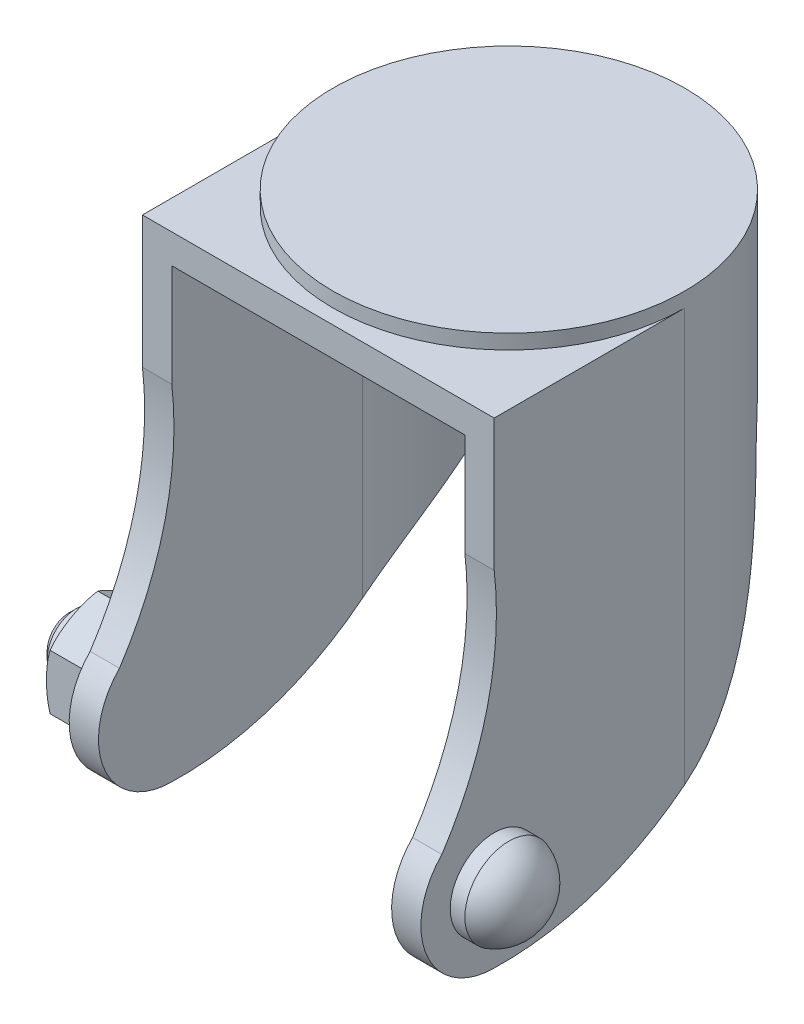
ISO-10303-21;
HEADER;
FILE_DESCRIPTION(('STEP AP214'),'2;1');
FILE_NAME('part.step','',(''),(''),'','','');
FILE_SCHEMA(('AUTOMOTIVE_DESIGN { 1 0 10303 214 1 1 1 1 }'));
ENDSEC;
DATA;
#1=APPLICATION_CONTEXT('core data for automotive mechanical design processes');
#2=APPLICATION_PROTOCOL_DEFINITION('international standard','automotive_design',2000,#1);
#3=PRODUCT_CONTEXT('',#1,'mechanical');
#4=PRODUCT('Part','Part','',(#3));
#5=PRODUCT_RELATED_PRODUCT_CATEGORY('part','',(#4));
#6=PRODUCT_DEFINITION_FORMATION('','',#4);
#7=PRODUCT_DEFINITION_CONTEXT('part definition',#1,'design');
#8=PRODUCT_DEFINITION('design','',#6,#7);
#9=PRODUCT_DEFINITION_SHAPE('','',#8);
#10=(LENGTH_UNIT() NAMED_UNIT(*) SI_UNIT(.MILLI.,.METRE.));
#11=(NAMED_UNIT(*) PLANE_ANGLE_UNIT() SI_UNIT($,.RADIAN.));
#12=(NAMED_UNIT(*) SI_UNIT($,.STERADIAN.) SOLID_ANGLE_UNIT());
#13=UNCERTAINTY_MEASURE_WITH_UNIT(LENGTH_MEASURE(1.E-05),#10,'distance_accuracy_value','');
#14=(GEOMETRIC_REPRESENTATION_CONTEXT(3) GLOBAL_UNCERTAINTY_ASSIGNED_CONTEXT((#13)) GLOBAL_UNIT_ASSIGNED_CONTEXT((#10,
#11,#12)) REPRESENTATION_CONTEXT('',''));
#15=CARTESIAN_POINT('',(0.,0.,0.));
#16=DIRECTION('',(0.,0.,1.));
#17=DIRECTION('',(1.,0.,0.));
#18=AXIS2_PLACEMENT_3D('',#15,#16,#17);
#19=CARTESIAN_POINT('',(-34.,-57.,26.));
#20=DIRECTION('',(1.,0.,0.));
#21=DIRECTION('',(0.,0.,-1.));
#22=AXIS2_PLACEMENT_3D('',#19,#20,#21);
#23=PLANE('',#22);
#24=CARTESIAN_POINT('',(-33.9999999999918,-57.,26.));
#25=DIRECTION('',(1.,0.,0.));
#26=DIRECTION('',(0.,0.,-1.));
#27=AXIS2_PLACEMENT_3D('',#24,#25,#26);
#28=CIRCLE('',#27,3.00000000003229);
#29=CARTESIAN_POINT('',(-33.9999999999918,-57.,22.9999999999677));
#30=VERTEX_POINT('',#29);
#31=EDGE_CURVE('E20',#30,#30,#28,.T.);
#32=ORIENTED_EDGE('',*,*,#31,.F.);
#33=EDGE_LOOP('',(#32));
#34=FACE_BOUND('',#33,.T.);
#35=ADVANCED_FACE('F17',(#34),#23,.F.);
#36=CARTESIAN_POINT('',(-33.0000000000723,-57.,26.));
#37=DIRECTION('',(1.,0.,0.));
#38=DIRECTION('',(0.,0.,-1.));
#39=AXIS2_PLACEMENT_3D('',#36,#37,#38);
#40=CONICAL_SURFACE('',#39,3.9999999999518,0.785398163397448);
#41=CARTESIAN_POINT('',(-33.,-57.,26.));
#42=DIRECTION('',(-1.,0.,0.));
#43=DIRECTION('',(0.,0.,1.));
#44=AXIS2_PLACEMENT_3D('',#41,#42,#43);
#45=CIRCLE('',#44,4.);
#46=CARTESIAN_POINT('',(-33.,-57.,30.));
#47=VERTEX_POINT('',#46);
#48=EDGE_CURVE('E217',#47,#47,#45,.F.);
#49=ORIENTED_EDGE('',*,*,#48,.F.);
#50=EDGE_LOOP('',(#49));
#51=FACE_BOUND('',#50,.T.);
#52=ORIENTED_EDGE('',*,*,#31,.T.);
#53=EDGE_LOOP('',(#52));
#54=FACE_BOUND('',#53,.T.);
#55=ADVANCED_FACE('F527',(#51,#54),#40,.T.);
#56=CARTESIAN_POINT('',(-24.,-57.,26.));
#57=DIRECTION('',(-1.,0.,0.));
#58=DIRECTION('',(0.,0.,1.));
#59=AXIS2_PLACEMENT_3D('',#56,#57,#58);
#60=CYLINDRICAL_SURFACE('',#59,4.);
#61=ORIENTED_EDGE('',*,*,#48,.T.);
#62=EDGE_LOOP('',(#61));
#63=FACE_BOUND('',#62,.T.);
#64=CARTESIAN_POINT('',(-31.,-57.,26.));
#65=DIRECTION('',(-1.,0.,0.));
#66=DIRECTION('',(0.,0.,1.));
#67=AXIS2_PLACEMENT_3D('',#64,#65,#66);
#68=CIRCLE('',#67,4.00000000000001);
#69=CARTESIAN_POINT('',(-31.,-57.,30.));
#70=VERTEX_POINT('',#69);
#71=EDGE_CURVE('E214',#70,#70,#68,.F.);
#72=ORIENTED_EDGE('',*,*,#71,.F.);
#73=EDGE_LOOP('',(#72));
#74=FACE_BOUND('',#73,.T.);
#75=ADVANCED_FACE('F187',(#63,#74),#60,.T.);
#76=CARTESIAN_POINT('',(-25.0087021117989,-57.,30.3230319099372));
#77=DIRECTION('',(0.,1.,0.));
#78=DIRECTION('',(0.,0.,1.));
#79=AXIS2_PLACEMENT_3D('',#76,#77,#78);
#80=CIRCLE('',#79,6.00000000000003);
#81=TRIMMED_CURVE('',#80,(PARAMETER_VALUE(-2.37532707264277)),
(PARAMETER_VALUE(2.37532707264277)),.T.,.PARAMETER.);
#82=CARTESIAN_POINT('',(-25.0087021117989,-57.,26.));
#83=DIRECTION('',(-1.,0.,0.));
#84=AXIS1_PLACEMENT('',#82,#83);
#85=SURFACE_OF_REVOLUTION('',#81,#84);
#86=ORIENTED_EDGE('',*,*,#71,.T.);
#87=EDGE_LOOP('',(#86));
#88=FACE_BOUND('',#87,.T.);
#89=CARTESIAN_POINT('',(-30.0951110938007,-49.4944465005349,26.));
#90=CARTESIAN_POINT('',(-30.1591947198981,-49.5968947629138,26.1774455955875));
#91=CARTESIAN_POINT('',(-30.2157607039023,-49.7004484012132,26.3568057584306));
#92=CARTESIAN_POINT('',(-30.3153080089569,-49.9088418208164,26.7177537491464));
#93=CARTESIAN_POINT('',(-30.3583314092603,-50.0136765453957,26.8993328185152));
#94=CARTESIAN_POINT('',(-30.4325975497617,-50.2242769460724,27.2641034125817));
#95=CARTESIAN_POINT('',(-30.4638493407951,-50.3300418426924,27.4472935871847));
#96=CARTESIAN_POINT('',(-30.5156115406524,-50.5403425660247,27.8115451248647));
#97=CARTESIAN_POINT('',(-30.5362999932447,-50.6448676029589,27.9925877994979));
#98=CARTESIAN_POINT('',(-30.5688604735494,-50.854343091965,28.3554099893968));
#99=CARTESIAN_POINT('',(-30.5807249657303,-50.9592938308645,28.5371900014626));
#100=CARTESIAN_POINT('',(-30.5963241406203,-51.169408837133,28.9011198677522));
#101=CARTESIAN_POINT('',(-30.6000537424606,-51.2745731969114,29.0832698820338));
#102=CARTESIAN_POINT('',(-30.5996070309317,-51.4839269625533,29.4458812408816));
#103=CARTESIAN_POINT('',(-30.5955033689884,-51.5881164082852,29.6263426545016));
#104=CARTESIAN_POINT('',(-30.5792821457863,-51.7962763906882,29.9868863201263));
#105=CARTESIAN_POINT('',(-30.5671696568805,-51.9002470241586,30.1669687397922));
#106=CARTESIAN_POINT('',(-30.5342407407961,-52.1077612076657,30.5263938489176));
#107=CARTESIAN_POINT('',(-30.5134317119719,-52.2113050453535,30.7057370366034));
#108=CARTESIAN_POINT('',(-30.46157856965,-52.4196097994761,31.066531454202));
#109=CARTESIAN_POINT('',(-30.4303607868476,-52.5243600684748,31.2479642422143));
#110=CARTESIAN_POINT('',(-30.3563533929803,-52.7329408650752,31.6092367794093));
#111=CARTESIAN_POINT('',(-30.3135548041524,-52.8367706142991,31.7890751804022));
#112=CARTESIAN_POINT('',(-30.2146941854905,-53.043173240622,32.1465750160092));
#113=CARTESIAN_POINT('',(-30.1585910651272,-53.1457411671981,32.3242278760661));
#114=CARTESIAN_POINT('',(-30.0951110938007,-53.2472232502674,32.5));
#115=B_SPLINE_CURVE_WITH_KNOTS('',3,(#89,#90,#91,#92,#93,#94,#95,#96,#97,#98,#99,#100,#101,#102,
#103,#104,#105,#106,#107,#108,#109,#110,#111,#112,#113,#114),.UNSPECIFIED.,.F.,.F.,(4,2,2,2,2,2,
2,2,2,2,2,2,4),(0.,0.643715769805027,1.28541119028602,1.92661221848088,2.55661612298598,
3.1871574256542,3.81809243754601,4.44320411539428,5.06792026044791,5.69210602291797,
6.32727598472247,6.96293976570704,7.60059294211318),.UNSPECIFIED.);
#116=CARTESIAN_POINT('',(-30.0951110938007,-49.4944465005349,26.));
#117=VERTEX_POINT('',#116);
#118=CARTESIAN_POINT('',(-30.0951110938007,-53.2472232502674,32.5));
#119=VERTEX_POINT('',#118);
#120=EDGE_CURVE('E284',#117,#119,#115,.T.);
#121=ORIENTED_EDGE('',*,*,#120,.F.);
#122=CARTESIAN_POINT('',(-30.0951110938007,-53.2472232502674,19.5));
#123=CARTESIAN_POINT('',(-30.1591947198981,-53.1447749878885,19.6774455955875));
#124=CARTESIAN_POINT('',(-30.2157607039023,-53.0412213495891,19.8568057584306));
#125=CARTESIAN_POINT('',(-30.3153080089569,-52.8328279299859,20.2177537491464));
#126=CARTESIAN_POINT('',(-30.3583314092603,-52.7279932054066,20.3993328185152));
#127=CARTESIAN_POINT('',(-30.4325975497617,-52.5173928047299,20.7641034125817));
#128=CARTESIAN_POINT('',(-30.4638493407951,-52.4116279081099,20.9472935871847));
#129=CARTESIAN_POINT('',(-30.5156115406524,-52.2013271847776,21.3115451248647));
#130=CARTESIAN_POINT('',(-30.5362999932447,-52.0968021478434,21.4925877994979));
#131=CARTESIAN_POINT('',(-30.5688604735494,-51.8873266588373,21.8554099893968));
#132=CARTESIAN_POINT('',(-30.5807249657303,-51.7823759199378,22.0371900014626));
#133=CARTESIAN_POINT('',(-30.5963241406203,-51.5722609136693,22.4011198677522));
#134=CARTESIAN_POINT('',(-30.6000537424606,-51.4670965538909,22.5832698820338));
#135=CARTESIAN_POINT('',(-30.5996070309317,-51.257742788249,22.9458812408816));
#136=CARTESIAN_POINT('',(-30.5955033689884,-51.1535533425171,23.1263426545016));
#137=CARTESIAN_POINT('',(-30.5792821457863,-50.9453933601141,23.4868863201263));
#138=CARTESIAN_POINT('',(-30.5671696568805,-50.8414227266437,23.6669687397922));
#139=CARTESIAN_POINT('',(-30.5342407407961,-50.6339085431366,24.0263938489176));
#140=CARTESIAN_POINT('',(-30.5134317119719,-50.5303647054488,24.2057370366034));
#141=CARTESIAN_POINT('',(-30.46157856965,-50.3220599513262,24.566531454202));
#142=CARTESIAN_POINT('',(-30.4303607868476,-50.2173096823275,24.7479642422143));
#143=CARTESIAN_POINT('',(-30.3563533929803,-50.0087288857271,25.1092367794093));
#144=CARTESIAN_POINT('',(-30.3135548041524,-49.9048991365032,25.2890751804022));
#145=CARTESIAN_POINT('',(-30.2146941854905,-49.6984965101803,25.6465750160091));
#146=CARTESIAN_POINT('',(-30.1585910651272,-49.5959285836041,25.8242278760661));
#147=CARTESIAN_POINT('',(-30.0951110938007,-49.4944465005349,26.));
#148=B_SPLINE_CURVE_WITH_KNOTS('',3,(#122,#123,#124,#125,#126,#127,#128,#129,#130,#131,#132,
#133,#134,#135,#136,#137,#138,#139,#140,#141,#142,#143,#144,#145,#146,#147),.UNSPECIFIED.,.F.,
.F.,(4,2,2,2,2,2,2,2,2,2,2,2,4),(0.,0.643715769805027,1.28541119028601,1.92661221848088,
2.55661612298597,3.1871574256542,3.818092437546,4.44320411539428,5.06792026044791,
5.69210602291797,6.32727598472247,6.96293976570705,7.60059294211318),.UNSPECIFIED.);
#149=CARTESIAN_POINT('',(-30.0951110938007,-53.2472232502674,19.5));
#150=VERTEX_POINT('',#149);
#151=EDGE_CURVE('E337',#150,#117,#148,.T.);
#152=ORIENTED_EDGE('',*,*,#151,.F.);
#153=CARTESIAN_POINT('',(-30.0951110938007,-60.7527767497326,19.5));
#154=CARTESIAN_POINT('',(-30.1588928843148,-60.5488464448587,19.5));
#155=CARTESIAN_POINT('',(-30.2152275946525,-60.3427249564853,19.5));
#156=CARTESIAN_POINT('',(-30.3144320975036,-59.9279291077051,19.5));
#157=CARTESIAN_POINT('',(-30.3573434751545,-59.7192647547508,19.5));
#158=CARTESIAN_POINT('',(-30.4314811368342,-59.3000837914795,19.5));
#159=CARTESIAN_POINT('',(-30.462716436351,-59.0895687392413,19.5));
#160=CARTESIAN_POINT('',(-30.5145252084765,-58.6709633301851,19.5));
#161=CARTESIAN_POINT('',(-30.5352745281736,-58.4628944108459,19.5));
#162=CARTESIAN_POINT('',(-30.5680204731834,-58.045904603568,19.5));
#163=CARTESIAN_POINT('',(-30.580009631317,-57.8369831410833,19.5));
#164=CARTESIAN_POINT('',(-30.5959213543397,-57.4187079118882,19.5));
#165=CARTESIAN_POINT('',(-30.5998388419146,-57.2093539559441,19.5));
#166=CARTESIAN_POINT('',(-30.5998388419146,-56.7906460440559,19.5));
#167=CARTESIAN_POINT('',(-30.5959213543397,-56.5812920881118,19.5));
#168=CARTESIAN_POINT('',(-30.580009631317,-56.1630168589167,19.5));
#169=CARTESIAN_POINT('',(-30.5680204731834,-55.954095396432,19.5));
#170=CARTESIAN_POINT('',(-30.5352745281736,-55.5371055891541,19.5));
#171=CARTESIAN_POINT('',(-30.5145252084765,-55.3290366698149,19.5));
#172=CARTESIAN_POINT('',(-30.462716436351,-54.9104312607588,19.5));
#173=CARTESIAN_POINT('',(-30.4314811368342,-54.6999162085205,19.5));
#174=CARTESIAN_POINT('',(-30.3573434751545,-54.2807352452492,19.5));
#175=CARTESIAN_POINT('',(-30.3144320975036,-54.0720708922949,19.5));
#176=CARTESIAN_POINT('',(-30.2152275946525,-53.6572750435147,19.5));
#177=CARTESIAN_POINT('',(-30.1588928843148,-53.4511535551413,19.5));
#178=CARTESIAN_POINT('',(-30.0951110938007,-53.2472232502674,19.5));
#179=B_SPLINE_CURVE_WITH_KNOTS('',3,(#153,#154,#155,#156,#157,#158,#159,#160,#161,#162,#163,
#164,#165,#166,#167,#168,#169,#170,#171,#172,#173,#174,#175,#176,#177,#178),.UNSPECIFIED.,.F.,
.F.,(4,2,2,2,2,2,2,2,2,2,2,2,4),(0.,0.640684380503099,1.27936381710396,1.91754908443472,
2.5446440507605,3.17227293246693,3.8002964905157,4.42832004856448,5.05594893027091,
5.68304389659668,6.32122916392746,6.95990860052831,7.60059298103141),.UNSPECIFIED.);
#180=CARTESIAN_POINT('',(-30.0951110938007,-60.7527767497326,19.5));
#181=VERTEX_POINT('',#180);
#182=EDGE_CURVE('E333',#181,#150,#179,.T.);
#183=ORIENTED_EDGE('',*,*,#182,.F.);
#184=CARTESIAN_POINT('',(-30.0951110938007,-64.5055534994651,26.));
#185=CARTESIAN_POINT('',(-30.1591947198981,-64.4031052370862,25.8225544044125));
#186=CARTESIAN_POINT('',(-30.2157607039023,-64.2995515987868,25.6431942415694));
#187=CARTESIAN_POINT('',(-30.3153080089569,-64.0911581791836,25.2822462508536));
#188=CARTESIAN_POINT('',(-30.3583314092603,-63.9863234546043,25.1006671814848));
#189=CARTESIAN_POINT('',(-30.4325975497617,-63.7757230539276,24.7358965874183));
#190=CARTESIAN_POINT('',(-30.4638493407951,-63.6699581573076,24.5527064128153));
#191=CARTESIAN_POINT('',(-30.5156115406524,-63.4596574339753,24.1884548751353));
#192=CARTESIAN_POINT('',(-30.5362999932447,-63.3551323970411,24.0074122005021));
#193=CARTESIAN_POINT('',(-30.5688604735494,-63.145656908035,23.6445900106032));
#194=CARTESIAN_POINT('',(-30.5807249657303,-63.0407061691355,23.4628099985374));
#195=CARTESIAN_POINT('',(-30.5963241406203,-62.830591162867,23.0988801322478));
#196=CARTESIAN_POINT('',(-30.6000537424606,-62.7254268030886,22.9167301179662));
#197=CARTESIAN_POINT('',(-30.5996070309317,-62.5160730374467,22.5541187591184));
#198=CARTESIAN_POINT('',(-30.5955033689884,-62.4118835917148,22.3736573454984));
#199=CARTESIAN_POINT('',(-30.5792821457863,-62.2037236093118,22.0131136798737));
#200=CARTESIAN_POINT('',(-30.5671696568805,-62.0997529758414,21.8330312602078));
#201=CARTESIAN_POINT('',(-30.5342407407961,-61.8922387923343,21.4736061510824));
#202=CARTESIAN_POINT('',(-30.5134317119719,-61.7886949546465,21.2942629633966));
#203=CARTESIAN_POINT('',(-30.46157856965,-61.5803902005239,20.933468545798));
#204=CARTESIAN_POINT('',(-30.4303607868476,-61.4756399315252,20.7520357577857));
#205=CARTESIAN_POINT('',(-30.3563533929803,-61.2670591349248,20.3907632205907));
#206=CARTESIAN_POINT('',(-30.3135548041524,-61.1632293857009,20.2109248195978));
#207=CARTESIAN_POINT('',(-30.2146941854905,-60.956826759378,19.8534249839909));
#208=CARTESIAN_POINT('',(-30.1585910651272,-60.8542588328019,19.6757721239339));
#209=CARTESIAN_POINT('',(-30.0951110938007,-60.7527767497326,19.5));
#210=B_SPLINE_CURVE_WITH_KNOTS('',3,(#184,#185,#186,#187,#188,#189,#190,#191,#192,#193,#194,
#195,#196,#197,#198,#199,#200,#201,#202,#203,#204,#205,#206,#207,#208,#209),.UNSPECIFIED.,.F.,
.F.,(4,2,2,2,2,2,2,2,2,2,2,2,4),(0.,0.643715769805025,1.28541119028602,1.92661221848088,
2.55661612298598,3.1871574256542,3.81809243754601,4.44320411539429,5.06792026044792,
5.69210602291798,6.32727598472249,6.96293976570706,7.6005929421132),.UNSPECIFIED.);
#211=CARTESIAN_POINT('',(-30.0951110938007,-64.5055534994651,26.));
#212=VERTEX_POINT('',#211);
#213=EDGE_CURVE('E326',#212,#181,#210,.T.);
#214=ORIENTED_EDGE('',*,*,#213,.F.);
#215=CARTESIAN_POINT('',(-30.0951110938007,-60.7527767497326,32.5));
#216=CARTESIAN_POINT('',(-30.1591947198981,-60.8552250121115,32.3225544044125));
#217=CARTESIAN_POINT('',(-30.2157607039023,-60.9587786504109,32.1431942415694));
#218=CARTESIAN_POINT('',(-30.3153080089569,-61.1671720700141,31.7822462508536));
#219=CARTESIAN_POINT('',(-30.3583314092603,-61.2720067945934,31.6006671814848));
#220=CARTESIAN_POINT('',(-30.4325975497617,-61.4826071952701,31.2358965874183));
#221=CARTESIAN_POINT('',(-30.4638493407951,-61.5883720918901,31.0527064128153));
#222=CARTESIAN_POINT('',(-30.5156115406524,-61.7986728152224,30.6884548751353));
#223=CARTESIAN_POINT('',(-30.5362999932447,-61.9031978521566,30.5074122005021));
#224=CARTESIAN_POINT('',(-30.5688604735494,-62.1126733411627,30.1445900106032));
#225=CARTESIAN_POINT('',(-30.5807249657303,-62.2176240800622,29.9628099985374));
#226=CARTESIAN_POINT('',(-30.5963241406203,-62.4277390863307,29.5988801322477));
#227=CARTESIAN_POINT('',(-30.6000537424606,-62.5329034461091,29.4167301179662));
#228=CARTESIAN_POINT('',(-30.5996070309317,-62.7422572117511,29.0541187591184));
#229=CARTESIAN_POINT('',(-30.5955033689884,-62.8464466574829,28.8736573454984));
#230=CARTESIAN_POINT('',(-30.5792821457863,-63.0546066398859,28.5131136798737));
#231=CARTESIAN_POINT('',(-30.5671696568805,-63.1585772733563,28.3330312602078));
#232=CARTESIAN_POINT('',(-30.5342407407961,-63.3660914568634,27.9736061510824));
#233=CARTESIAN_POINT('',(-30.5134317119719,-63.4696352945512,27.7942629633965));
#234=CARTESIAN_POINT('',(-30.46157856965,-63.6779400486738,27.433468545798));
#235=CARTESIAN_POINT('',(-30.4303607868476,-63.7826903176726,27.2520357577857));
#236=CARTESIAN_POINT('',(-30.3563533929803,-63.9912711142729,26.8907632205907));
#237=CARTESIAN_POINT('',(-30.3135548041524,-64.0951008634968,26.7109248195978));
#238=CARTESIAN_POINT('',(-30.2146941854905,-64.3015034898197,26.3534249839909));
#239=CARTESIAN_POINT('',(-30.1585910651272,-64.4040714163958,26.1757721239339));
#240=CARTESIAN_POINT('',(-30.0951110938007,-64.5055534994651,26.));
#241=B_SPLINE_CURVE_WITH_KNOTS('',3,(#215,#216,#217,#218,#219,#220,#221,#222,#223,#224,#225,
#226,#227,#228,#229,#230,#231,#232,#233,#234,#235,#236,#237,#238,#239,#240),.UNSPECIFIED.,.F.,
.F.,(4,2,2,2,2,2,2,2,2,2,2,2,4),(0.,0.643715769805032,1.28541119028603,1.92661221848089,
2.55661612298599,3.18715742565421,3.81809243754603,4.44320411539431,5.06792026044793,
5.69210602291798,6.32727598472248,6.96293976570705,7.60059294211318),.UNSPECIFIED.);
#242=CARTESIAN_POINT('',(-30.0951110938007,-60.7527767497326,32.5));
#243=VERTEX_POINT('',#242);
#244=EDGE_CURVE('E319',#243,#212,#241,.T.);
#245=ORIENTED_EDGE('',*,*,#244,.F.);
#246=CARTESIAN_POINT('',(-30.0951110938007,-53.2472232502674,32.5));
#247=CARTESIAN_POINT('',(-30.1588928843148,-53.4511535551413,32.5));
#248=CARTESIAN_POINT('',(-30.2152275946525,-53.6572750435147,32.5));
#249=CARTESIAN_POINT('',(-30.3144320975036,-54.0720708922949,32.5));
#250=CARTESIAN_POINT('',(-30.3573434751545,-54.2807352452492,32.5));
#251=CARTESIAN_POINT('',(-30.4314811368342,-54.6999162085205,32.5));
#252=CARTESIAN_POINT('',(-30.462716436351,-54.9104312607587,32.5));
#253=CARTESIAN_POINT('',(-30.5145252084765,-55.3290366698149,32.5));
#254=CARTESIAN_POINT('',(-30.5352745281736,-55.5371055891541,32.5));
#255=CARTESIAN_POINT('',(-30.5680204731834,-55.954095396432,32.5));
#256=CARTESIAN_POINT('',(-30.580009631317,-56.1630168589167,32.5));
#257=CARTESIAN_POINT('',(-30.5959213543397,-56.5812920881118,32.5));
#258=CARTESIAN_POINT('',(-30.5998388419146,-56.7906460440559,32.5));
#259=CARTESIAN_POINT('',(-30.5998388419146,-57.2093539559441,32.5));
#260=CARTESIAN_POINT('',(-30.5959213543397,-57.4187079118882,32.5));
#261=CARTESIAN_POINT('',(-30.580009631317,-57.8369831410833,32.5));
#262=CARTESIAN_POINT('',(-30.5680204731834,-58.045904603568,32.5));
#263=CARTESIAN_POINT('',(-30.5352745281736,-58.4628944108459,32.5));
#264=CARTESIAN_POINT('',(-30.5145252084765,-58.6709633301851,32.5));
#265=CARTESIAN_POINT('',(-30.462716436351,-59.0895687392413,32.5));
#266=CARTESIAN_POINT('',(-30.4314811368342,-59.3000837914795,32.5));
#267=CARTESIAN_POINT('',(-30.3573434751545,-59.7192647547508,32.5));
#268=CARTESIAN_POINT('',(-30.3144320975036,-59.9279291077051,32.5));
#269=CARTESIAN_POINT('',(-30.2152275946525,-60.3427249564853,32.5));
#270=CARTESIAN_POINT('',(-30.1588928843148,-60.5488464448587,32.5));
#271=CARTESIAN_POINT('',(-30.0951110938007,-60.7527767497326,32.5));
#272=B_SPLINE_CURVE_WITH_KNOTS('',3,(#246,#247,#248,#249,#250,#251,#252,#253,#254,#255,#256,
#257,#258,#259,#260,#261,#262,#263,#264,#265,#266,#267,#268,#269,#270,#271),.UNSPECIFIED.,.F.,
.F.,(4,2,2,2,2,2,2,2,2,2,2,2,4),(0.,0.6406843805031,1.27936381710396,1.91754908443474,
2.54464405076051,3.17227293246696,3.80029649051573,4.42832004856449,5.05594893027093,
5.6830438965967,6.32122916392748,6.95990860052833,7.60059298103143),.UNSPECIFIED.);
#273=EDGE_CURVE('E293',#119,#243,#272,.T.);
#274=ORIENTED_EDGE('',*,*,#273,.F.);
#275=EDGE_LOOP('',(#121,#152,#183,#214,#245,#274));
#276=FACE_BOUND('',#275,.T.);
#277=ADVANCED_FACE('F180',(#88,#276),#85,.F.);
#278=CARTESIAN_POINT('',(24.4218120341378,-57.,26.6145413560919));
#279=DIRECTION('',(0.,1.,0.));
#280=DIRECTION('',(0.,0.,1.));
#281=AXIS2_PLACEMENT_3D('',#278,#279,#280);
#282=CIRCLE('',#281,5.61193746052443);
#283=TRIMMED_CURVE('',#282,(PARAMETER_VALUE(-1.68052246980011)),
(PARAMETER_VALUE(1.68052246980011)),.T.,.PARAMETER.);
#284=CARTESIAN_POINT('',(24.4218120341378,-57.,26.));
#285=DIRECTION('',(-1.,0.,0.));
#286=AXIS1_PLACEMENT('',#284,#285);
#287=SURFACE_OF_REVOLUTION('',#283,#286);
#288=CARTESIAN_POINT('',(30.,-57.,26.));
#289=VERTEX_POINT('',#288);
#290=VERTEX_LOOP('',#289);
#291=FACE_BOUND('',#290,.T.);
#292=CARTESIAN_POINT('',(26.,-57.,26.));
#293=DIRECTION('',(-1.,0.,0.));
#294=DIRECTION('',(0.,0.,1.));
#295=AXIS2_PLACEMENT_3D('',#292,#293,#294);
#296=CIRCLE('',#295,6.);
#297=CARTESIAN_POINT('',(26.,-57.,32.));
#298=VERTEX_POINT('',#297);
#299=EDGE_CURVE('E167',#298,#298,#296,.T.);
#300=ORIENTED_EDGE('',*,*,#299,.F.);
#301=EDGE_LOOP('',(#300));
#302=FACE_BOUND('',#301,.T.);
#303=ADVANCED_FACE('F175',(#291,#302),#287,.F.);
#304=CARTESIAN_POINT('',(0.,-2.,0.));
#305=DIRECTION('',(0.,1.,0.));
#306=DIRECTION('',(0.,0.,1.));
#307=AXIS2_PLACEMENT_3D('',#304,#305,#306);
#308=PLANE('',#307);
#309=CARTESIAN_POINT('',(0.,-2.,0.));
#310=DIRECTION('',(0.,1.,0.));
#311=DIRECTION('',(0.,0.,1.));
#312=AXIS2_PLACEMENT_3D('',#309,#310,#311);
#313=CIRCLE('',#312,20.);
#314=CARTESIAN_POINT('',(0.,-2.,20.));
#315=VERTEX_POINT('',#314);
#316=EDGE_CURVE('E276',#315,#315,#313,.F.);
#317=ORIENTED_EDGE('',*,*,#316,.T.);
#318=EDGE_LOOP('',(#317));
#319=FACE_BOUND('',#318,.T.);
#320=ADVANCED_FACE('F179',(#319),#308,.F.);
#321=CARTESIAN_POINT('',(20.,-6.,41.));
#322=DIRECTION('',(0.,-1.,0.));
#323=DIRECTION('',(0.,0.,-1.));
#324=AXIS2_PLACEMENT_3D('',#321,#322,#323);
#325=PLANE('',#324);
#326=CARTESIAN_POINT('',(0.,-6.00000000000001,0.));
#327=DIRECTION('',(0.,1.,0.));
#328=DIRECTION('',(0.,0.,1.));
#329=AXIS2_PLACEMENT_3D('',#326,#327,#328);
#330=CIRCLE('',#329,20.);
#331=CARTESIAN_POINT('',(-20.,-6.00000000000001,0.));
#332=VERTEX_POINT('',#331);
#333=CARTESIAN_POINT('',(20.,-6.00000000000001,0.));
#334=VERTEX_POINT('',#333);
#335=EDGE_CURVE('E273',#332,#334,#330,.T.);
#336=ORIENTED_EDGE('',*,*,#335,.T.);
#337=DIRECTION('',(0.,0.,1.));
#338=VECTOR('',#337,1.);
#339=CARTESIAN_POINT('',(20.,-6.00000000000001,41.));
#340=LINE('',#339,#338);
#341=CARTESIAN_POINT('',(20.,-6.,26.));
#342=VERTEX_POINT('',#341);
#343=EDGE_CURVE('E154',#342,#334,#340,.F.);
#344=ORIENTED_EDGE('',*,*,#343,.F.);
#345=DIRECTION('',(-1.,0.,0.));
#346=VECTOR('',#345,1.);
#347=CARTESIAN_POINT('',(-100.,-6.,26.));
#348=LINE('',#347,#346);
#349=CARTESIAN_POINT('',(-20.,-6.,26.));
#350=VERTEX_POINT('',#349);
#351=EDGE_CURVE('E160',#342,#350,#348,.T.);
#352=ORIENTED_EDGE('',*,*,#351,.T.);
#353=DIRECTION('',(0.,0.,-1.));
#354=VECTOR('',#353,1.);
#355=CARTESIAN_POINT('',(-20.,-6.00000000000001,41.));
#356=LINE('',#355,#354);
#357=EDGE_CURVE('E143',#332,#350,#356,.F.);
#358=ORIENTED_EDGE('',*,*,#357,.F.);
#359=EDGE_LOOP('',(#336,#344,#352,#358));
#360=FACE_BOUND('',#359,.T.);
#361=ADVANCED_FACE('F359',(#360),#325,.T.);
#362=CARTESIAN_POINT('',(-20.,-6.,41.));
#363=DIRECTION('',(1.,0.,0.));
#364=DIRECTION('',(0.,0.,-1.));
#365=AXIS2_PLACEMENT_3D('',#362,#363,#364);
#366=PLANE('',#365);
#367=DIRECTION('',(0.,1.,0.));
#368=VECTOR('',#367,1.);
#369=CARTESIAN_POINT('',(-20.,-102.,0.));
#370=LINE('',#369,#368);
#371=CARTESIAN_POINT('',(-20.,-58.3293815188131,0.));
#372=VERTEX_POINT('',#371);
#373=EDGE_CURVE('E573',#372,#332,#370,.T.);
#374=ORIENTED_EDGE('',*,*,#373,.T.);
#375=ORIENTED_EDGE('',*,*,#357,.T.);
#376=DIRECTION('',(0.,1.,0.));
#377=VECTOR('',#376,1.);
#378=CARTESIAN_POINT('',(-20.,-20.,26.));
#379=LINE('',#378,#377);
#380=CARTESIAN_POINT('',(-20.,-19.9999999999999,26.));
#381=VERTEX_POINT('',#380);
#382=EDGE_CURVE('E163',#350,#381,#379,.F.);
#383=ORIENTED_EDGE('',*,*,#382,.T.);
#384=CARTESIAN_POINT('',(-20.,-25.2098920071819,70.6973939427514));
#385=DIRECTION('',(1.,0.,0.));
#386=DIRECTION('',(0.,0.,-1.));
#387=AXIS2_PLACEMENT_3D('',#384,#385,#386);
#388=CIRCLE('',#387,45.);
#389=CARTESIAN_POINT('',(-20.,-50.,33.1414284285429));
#390=VERTEX_POINT('',#389);
#391=EDGE_CURVE('E139',#381,#390,#388,.F.);
#392=ORIENTED_EDGE('',*,*,#391,.T.);
#393=CARTESIAN_POINT('',(-20.,-57.,26.));
#394=DIRECTION('',(1.,0.,0.));
#395=DIRECTION('',(0.,0.,-1.));
#396=AXIS2_PLACEMENT_3D('',#393,#394,#395);
#397=CIRCLE('',#396,10.);
#398=CARTESIAN_POINT('',(-20.,-67.,26.0000000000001));
#399=VERTEX_POINT('',#398);
#400=EDGE_CURVE('E136',#399,#390,#397,.F.);
#401=ORIENTED_EDGE('',*,*,#400,.F.);
#402=CARTESIAN_POINT('',(-20.,-27.0154458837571,24.8885000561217));
#403=DIRECTION('',(1.,0.,0.));
#404=DIRECTION('',(0.,0.,-1.));
#405=AXIS2_PLACEMENT_3D('',#402,#403,#404);
#406=CIRCLE('',#405,40.);
#407=EDGE_CURVE('E121',#372,#399,#406,.F.);
#408=ORIENTED_EDGE('',*,*,#407,.F.);
#409=EDGE_LOOP('',(#374,#375,#383,#392,#401,#408));
#410=FACE_BOUND('',#409,.T.);
#411=ADVANCED_FACE('F137',(#410),#366,.T.);
#412=CARTESIAN_POINT('',(-100.,-57.,26.));
#413=DIRECTION('',(1.,0.,0.));
#414=DIRECTION('',(0.,0.,-1.));
#415=AXIS2_PLACEMENT_3D('',#412,#413,#414);
#416=CYLINDRICAL_SURFACE('',#415,10.);
#417=DIRECTION('',(1.,0.,0.));
#418=VECTOR('',#417,1.);
#419=CARTESIAN_POINT('',(-100.,-50.,33.1414284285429));
#420=LINE('',#419,#418);
#421=CARTESIAN_POINT('',(-24.,-50.,33.1414284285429));
#422=VERTEX_POINT('',#421);
#423=EDGE_CURVE('E594',#390,#422,#420,.F.);
#424=ORIENTED_EDGE('',*,*,#423,.T.);
#425=CARTESIAN_POINT('',(-24.,-57.,26.));
#426=DIRECTION('',(1.,0.,0.));
#427=DIRECTION('',(0.,0.,-1.));
#428=AXIS2_PLACEMENT_3D('',#425,#426,#427);
#429=CIRCLE('',#428,10.);
#430=CARTESIAN_POINT('',(-24.,-67.,26.0000000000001));
#431=VERTEX_POINT('',#430);
#432=EDGE_CURVE('E146',#422,#431,#429,.T.);
#433=ORIENTED_EDGE('',*,*,#432,.T.);
#434=DIRECTION('',(1.,0.,0.));
#435=VECTOR('',#434,1.);
#436=CARTESIAN_POINT('',(-100.,-67.,26.0000000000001));
#437=LINE('',#436,#435);
#438=EDGE_CURVE('E126',#399,#431,#437,.F.);
#439=ORIENTED_EDGE('',*,*,#438,.F.);
#440=ORIENTED_EDGE('',*,*,#400,.T.);
#441=EDGE_LOOP('',(#424,#433,#439,#440));
#442=FACE_BOUND('',#441,.T.);
#443=ADVANCED_FACE('F145',(#442),#416,.T.);
#444=CARTESIAN_POINT('',(-100.,-25.2098920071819,70.6973939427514));
#445=DIRECTION('',(1.,0.,0.));
#446=DIRECTION('',(0.,0.,-1.));
#447=AXIS2_PLACEMENT_3D('',#444,#445,#446);
#448=CYLINDRICAL_SURFACE('',#447,45.);
#449=CARTESIAN_POINT('',(-24.,-25.2098920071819,70.6973939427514));
#450=DIRECTION('',(1.,0.,0.));
#451=DIRECTION('',(0.,0.,-1.));
#452=AXIS2_PLACEMENT_3D('',#449,#450,#451);
#453=CIRCLE('',#452,45.);
#454=CARTESIAN_POINT('',(-24.,-19.9999999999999,26.));
#455=VERTEX_POINT('',#454);
#456=EDGE_CURVE('E663',#455,#422,#453,.F.);
#457=ORIENTED_EDGE('',*,*,#456,.T.);
#458=ORIENTED_EDGE('',*,*,#423,.F.);
#459=ORIENTED_EDGE('',*,*,#391,.F.);
#460=DIRECTION('',(-1.,0.,0.));
#461=VECTOR('',#460,1.);
#462=CARTESIAN_POINT('',(-100.,-20.,26.));
#463=LINE('',#462,#461);
#464=EDGE_CURVE('E152',#381,#455,#463,.T.);
#465=ORIENTED_EDGE('',*,*,#464,.T.);
#466=EDGE_LOOP('',(#457,#458,#459,#465));
#467=FACE_BOUND('',#466,.T.);
#468=ADVANCED_FACE('F351',(#467),#448,.F.);
#469=CARTESIAN_POINT('',(-34.,-53.2472232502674,19.5));
#470=DIRECTION('',(0.,0.866025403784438,-0.500000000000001));
#471=DIRECTION('',(0.,0.500000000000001,0.866025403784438));
#472=AXIS2_PLACEMENT_3D('',#469,#470,#471);
#473=PLANE('',#472);
#474=DIRECTION('',(0.,-0.5,-0.866025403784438));
#475=VECTOR('',#474,1.);
#476=CARTESIAN_POINT('',(-24.,-49.4944465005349,26.));
#477=LINE('',#476,#475);
#478=CARTESIAN_POINT('',(-24.,-49.4944465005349,26.));
#479=VERTEX_POINT('',#478);
#480=CARTESIAN_POINT('',(-24.,-53.2472232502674,19.5));
#481=VERTEX_POINT('',#480);
#482=EDGE_CURVE('E211',#479,#481,#477,.T.);
#483=ORIENTED_EDGE('',*,*,#482,.T.);
#484=DIRECTION('',(-1.,0.,0.));
#485=VECTOR('',#484,1.);
#486=CARTESIAN_POINT('',(-34.,-53.2472232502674,19.5));
#487=LINE('',#486,#485);
#488=EDGE_CURVE('E332',#150,#481,#487,.F.);
#489=ORIENTED_EDGE('',*,*,#488,.F.);
#490=ORIENTED_EDGE('',*,*,#151,.T.);
#491=DIRECTION('',(1.,0.,0.));
#492=VECTOR('',#491,1.);
#493=CARTESIAN_POINT('',(-34.,-49.4944465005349,26.));
#494=LINE('',#493,#492);
#495=EDGE_CURVE('E568',#479,#117,#494,.F.);
#496=ORIENTED_EDGE('',*,*,#495,.F.);
#497=EDGE_LOOP('',(#483,#489,#490,#496));
#498=FACE_BOUND('',#497,.T.);
#499=ADVANCED_FACE('F346',(#498),#473,.T.);
#500=CARTESIAN_POINT('',(-34.,-60.7527767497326,19.5));
#501=DIRECTION('',(0.,0.,-1.));
#502=DIRECTION('',(-1.,0.,0.));
#503=AXIS2_PLACEMENT_3D('',#500,#501,#502);
#504=PLANE('',#503);
#505=DIRECTION('',(0.,1.,0.));
#506=VECTOR('',#505,1.);
#507=CARTESIAN_POINT('',(-24.,-2.,19.5));
#508=LINE('',#507,#506);
#509=CARTESIAN_POINT('',(-24.,-60.7527767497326,19.5));
#510=VERTEX_POINT('',#509);
#511=EDGE_CURVE('E206',#481,#510,#508,.F.);
#512=ORIENTED_EDGE('',*,*,#511,.T.);
#513=DIRECTION('',(1.,0.,0.));
#514=VECTOR('',#513,1.);
#515=CARTESIAN_POINT('',(-34.,-60.7527767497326,19.5));
#516=LINE('',#515,#514);
#517=EDGE_CURVE('E325',#181,#510,#516,.T.);
#518=ORIENTED_EDGE('',*,*,#517,.F.);
#519=ORIENTED_EDGE('',*,*,#182,.T.);
#520=ORIENTED_EDGE('',*,*,#488,.T.);
#521=EDGE_LOOP('',(#512,#518,#519,#520));
#522=FACE_BOUND('',#521,.T.);
#523=ADVANCED_FACE('F343',(#522),#504,.T.);
#524=CARTESIAN_POINT('',(-34.,-64.5055534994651,26.));
#525=DIRECTION('',(0.,-0.866025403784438,-0.500000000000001));
#526=DIRECTION('',(0.,0.500000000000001,-0.866025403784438));
#527=AXIS2_PLACEMENT_3D('',#524,#525,#526);
#528=PLANE('',#527);
#529=DIRECTION('',(0.,-0.5,0.866025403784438));
#530=VECTOR('',#529,1.);
#531=CARTESIAN_POINT('',(-24.,-60.7527767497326,19.5));
#532=LINE('',#531,#530);
#533=CARTESIAN_POINT('',(-24.,-64.5055534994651,26.));
#534=VERTEX_POINT('',#533);
#535=EDGE_CURVE('E201',#510,#534,#532,.T.);
#536=ORIENTED_EDGE('',*,*,#535,.T.);
#537=DIRECTION('',(1.,0.,0.));
#538=VECTOR('',#537,1.);
#539=CARTESIAN_POINT('',(-34.,-64.5055534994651,26.));
#540=LINE('',#539,#538);
#541=EDGE_CURVE('E324',#212,#534,#540,.T.);
#542=ORIENTED_EDGE('',*,*,#541,.F.);
#543=ORIENTED_EDGE('',*,*,#213,.T.);
#544=ORIENTED_EDGE('',*,*,#517,.T.);
#545=EDGE_LOOP('',(#536,#542,#543,#544));
#546=FACE_BOUND('',#545,.T.);
#547=ADVANCED_FACE('F315',(#546),#528,.T.);
#548=CARTESIAN_POINT('',(-34.,-60.7527767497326,32.5));
#549=DIRECTION('',(0.,-0.866025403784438,0.500000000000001));
#550=DIRECTION('',(0.,-0.500000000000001,-0.866025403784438));
#551=AXIS2_PLACEMENT_3D('',#548,#549,#550);
#552=PLANE('',#551);
#553=DIRECTION('',(0.,0.500000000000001,0.866025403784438));
#554=VECTOR('',#553,1.);
#555=CARTESIAN_POINT('',(-24.,-64.5055534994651,26.));
#556=LINE('',#555,#554);
#557=CARTESIAN_POINT('',(-24.,-60.7527767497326,32.5));
#558=VERTEX_POINT('',#557);
#559=EDGE_CURVE('E197',#534,#558,#556,.T.);
#560=ORIENTED_EDGE('',*,*,#559,.T.);
#561=DIRECTION('',(1.,0.,0.));
#562=VECTOR('',#561,1.);
#563=CARTESIAN_POINT('',(-34.,-60.7527767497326,32.5));
#564=LINE('',#563,#562);
#565=EDGE_CURVE('E292',#243,#558,#564,.T.);
#566=ORIENTED_EDGE('',*,*,#565,.F.);
#567=ORIENTED_EDGE('',*,*,#244,.T.);
#568=ORIENTED_EDGE('',*,*,#541,.T.);
#569=EDGE_LOOP('',(#560,#566,#567,#568));
#570=FACE_BOUND('',#569,.T.);
#571=ADVANCED_FACE('F310',(#570),#552,.T.);
#572=CARTESIAN_POINT('',(-34.,-53.2472232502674,32.5));
#573=DIRECTION('',(0.,0.,1.));
#574=DIRECTION('',(1.,0.,0.));
#575=AXIS2_PLACEMENT_3D('',#572,#573,#574);
#576=PLANE('',#575);
#577=DIRECTION('',(0.,1.,0.));
#578=VECTOR('',#577,1.);
#579=CARTESIAN_POINT('',(-24.,-2.,32.5));
#580=LINE('',#579,#578);
#581=CARTESIAN_POINT('',(-24.,-53.2472232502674,32.5));
#582=VERTEX_POINT('',#581);
#583=EDGE_CURVE('E200',#558,#582,#580,.T.);
#584=ORIENTED_EDGE('',*,*,#583,.T.);
#585=DIRECTION('',(1.,0.,0.));
#586=VECTOR('',#585,1.);
#587=CARTESIAN_POINT('',(-34.,-53.2472232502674,32.5));
#588=LINE('',#587,#586);
#589=EDGE_CURVE('E291',#119,#582,#588,.T.);
#590=ORIENTED_EDGE('',*,*,#589,.F.);
#591=ORIENTED_EDGE('',*,*,#273,.T.);
#592=ORIENTED_EDGE('',*,*,#565,.T.);
#593=EDGE_LOOP('',(#584,#590,#591,#592));
#594=FACE_BOUND('',#593,.T.);
#595=ADVANCED_FACE('F304',(#594),#576,.T.);
#596=CARTESIAN_POINT('',(-34.,-49.4944465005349,26.));
#597=DIRECTION('',(0.,0.866025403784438,0.500000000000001));
#598=DIRECTION('',(0.,-0.500000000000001,0.866025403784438));
#599=AXIS2_PLACEMENT_3D('',#596,#597,#598);
#600=PLANE('',#599);
#601=DIRECTION('',(0.,0.500000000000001,-0.866025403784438));
#602=VECTOR('',#601,1.);
#603=CARTESIAN_POINT('',(-24.,-53.2472232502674,32.5));
#604=LINE('',#603,#602);
#605=EDGE_CURVE('E634',#582,#479,#604,.T.);
#606=ORIENTED_EDGE('',*,*,#605,.T.);
#607=ORIENTED_EDGE('',*,*,#495,.T.);
#608=ORIENTED_EDGE('',*,*,#120,.T.);
#609=ORIENTED_EDGE('',*,*,#589,.T.);
#610=EDGE_LOOP('',(#606,#607,#608,#609));
#611=FACE_BOUND('',#610,.T.);
#612=ADVANCED_FACE('F299',(#611),#600,.T.);
#613=CARTESIAN_POINT('',(-100.,-25.2098920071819,70.6973939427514));
#614=DIRECTION('',(1.,0.,0.));
#615=DIRECTION('',(0.,0.,-1.));
#616=AXIS2_PLACEMENT_3D('',#613,#614,#615);
#617=CYLINDRICAL_SURFACE('',#616,45.);
#618=CARTESIAN_POINT('',(20.,-25.2098920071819,70.6973939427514));
#619=DIRECTION('',(1.,0.,0.));
#620=DIRECTION('',(0.,0.,-1.));
#621=AXIS2_PLACEMENT_3D('',#618,#619,#620);
#622=CIRCLE('',#621,45.);
#623=CARTESIAN_POINT('',(20.,-50.,33.1414284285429));
#624=VERTEX_POINT('',#623);
#625=CARTESIAN_POINT('',(20.,-20.,26.));
#626=VERTEX_POINT('',#625);
#627=EDGE_CURVE('E279',#624,#626,#622,.T.);
#628=ORIENTED_EDGE('',*,*,#627,.F.);
#629=DIRECTION('',(1.,0.,0.));
#630=VECTOR('',#629,1.);
#631=CARTESIAN_POINT('',(-100.,-50.,33.1414284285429));
#632=LINE('',#631,#630);
#633=CARTESIAN_POINT('',(24.,-50.,33.1414284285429));
#634=VERTEX_POINT('',#633);
#635=EDGE_CURVE('E170',#634,#624,#632,.F.);
#636=ORIENTED_EDGE('',*,*,#635,.F.);
#637=CARTESIAN_POINT('',(24.,-25.2098920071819,70.6973939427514));
#638=DIRECTION('',(1.,0.,0.));
#639=DIRECTION('',(0.,0.,-1.));
#640=AXIS2_PLACEMENT_3D('',#637,#638,#639);
#641=CIRCLE('',#640,45.);
#642=CARTESIAN_POINT('',(24.,-20.,26.));
#643=VERTEX_POINT('',#642);
#644=EDGE_CURVE('E645',#634,#643,#641,.T.);
#645=ORIENTED_EDGE('',*,*,#644,.T.);
#646=DIRECTION('',(-1.,0.,0.));
#647=VECTOR('',#646,1.);
#648=CARTESIAN_POINT('',(-100.,-20.,26.));
#649=LINE('',#648,#647);
#650=EDGE_CURVE('E164',#643,#626,#649,.T.);
#651=ORIENTED_EDGE('',*,*,#650,.T.);
#652=EDGE_LOOP('',(#628,#636,#645,#651));
#653=FACE_BOUND('',#652,.T.);
#654=ADVANCED_FACE('F303',(#653),#617,.F.);
#655=CARTESIAN_POINT('',(-100.,-20.,26.));
#656=DIRECTION('',(0.,0.,-1.));
#657=DIRECTION('',(-1.,0.,0.));
#658=AXIS2_PLACEMENT_3D('',#655,#656,#657);
#659=PLANE('',#658);
#660=ORIENTED_EDGE('',*,*,#382,.F.);
#661=ORIENTED_EDGE('',*,*,#351,.F.);
#662=DIRECTION('',(0.,1.,0.));
#663=VECTOR('',#662,1.);
#664=CARTESIAN_POINT('',(20.,-104.,26.));
#665=LINE('',#664,#663);
#666=EDGE_CURVE('E157',#626,#342,#665,.T.);
#667=ORIENTED_EDGE('',*,*,#666,.F.);
#668=ORIENTED_EDGE('',*,*,#650,.F.);
#669=DIRECTION('',(0.,1.,0.));
#670=VECTOR('',#669,1.);
#671=CARTESIAN_POINT('',(24.,-100.,26.));
#672=LINE('',#671,#670);
#673=CARTESIAN_POINT('',(24.,-2.,26.));
#674=VERTEX_POINT('',#673);
#675=EDGE_CURVE('E641',#643,#674,#672,.T.);
#676=ORIENTED_EDGE('',*,*,#675,.T.);
#677=DIRECTION('',(1.,0.,0.));
#678=VECTOR('',#677,1.);
#679=CARTESIAN_POINT('',(24.,-2.,26.));
#680=LINE('',#679,#678);
#681=CARTESIAN_POINT('',(-24.,-2.,26.));
#682=VERTEX_POINT('',#681);
#683=EDGE_CURVE('E657',#674,#682,#680,.F.);
#684=ORIENTED_EDGE('',*,*,#683,.T.);
#685=DIRECTION('',(0.,1.,0.));
#686=VECTOR('',#685,1.);
#687=CARTESIAN_POINT('',(-24.,-2.,26.));
#688=LINE('',#687,#686);
#689=EDGE_CURVE('E660',#682,#455,#688,.F.);
#690=ORIENTED_EDGE('',*,*,#689,.T.);
#691=ORIENTED_EDGE('',*,*,#464,.F.);
#692=EDGE_LOOP('',(#660,#661,#667,#668,#676,#684,#690,#691));
#693=FACE_BOUND('',#692,.T.);
#694=ADVANCED_FACE('F440',(#693),#659,.F.);
#695=CARTESIAN_POINT('',(30.,-57.,26.));
#696=DIRECTION('',(-1.,0.,0.));
#697=DIRECTION('',(0.,0.,1.));
#698=AXIS2_PLACEMENT_3D('',#695,#696,#697);
#699=CYLINDRICAL_SURFACE('',#698,6.);
#700=ORIENTED_EDGE('',*,*,#299,.T.);
#701=EDGE_LOOP('',(#700));
#702=FACE_BOUND('',#701,.T.);
#703=CARTESIAN_POINT('',(24.,-57.,26.));
#704=DIRECTION('',(-1.,0.,0.));
#705=DIRECTION('',(0.,0.,1.));
#706=AXIS2_PLACEMENT_3D('',#703,#704,#705);
#707=CIRCLE('',#706,6.);
#708=CARTESIAN_POINT('',(24.,-57.,32.));
#709=VERTEX_POINT('',#708);
#710=EDGE_CURVE('E650',#709,#709,#707,.F.);
#711=ORIENTED_EDGE('',*,*,#710,.T.);
#712=EDGE_LOOP('',(#711));
#713=FACE_BOUND('',#712,.T.);
#714=ADVANCED_FACE('F433',(#702,#713),#699,.T.);
#715=CARTESIAN_POINT('',(-100.,-57.,26.));
#716=DIRECTION('',(1.,0.,0.));
#717=DIRECTION('',(0.,0.,-1.));
#718=AXIS2_PLACEMENT_3D('',#715,#716,#717);
#719=CYLINDRICAL_SURFACE('',#718,10.);
#720=DIRECTION('',(1.,0.,0.));
#721=VECTOR('',#720,1.);
#722=CARTESIAN_POINT('',(-100.,-67.,26.0000000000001));
#723=LINE('',#722,#721);
#724=CARTESIAN_POINT('',(24.,-67.,26.0000000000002));
#725=VERTEX_POINT('',#724);
#726=CARTESIAN_POINT('',(20.,-67.,26.0000000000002));
#727=VERTEX_POINT('',#726);
#728=EDGE_CURVE('E672',#725,#727,#723,.F.);
#729=ORIENTED_EDGE('',*,*,#728,.F.);
#730=CARTESIAN_POINT('',(24.,-57.,26.));
#731=DIRECTION('',(1.,0.,0.));
#732=DIRECTION('',(0.,0.,-1.));
#733=AXIS2_PLACEMENT_3D('',#730,#731,#732);
#734=CIRCLE('',#733,10.);
#735=EDGE_CURVE('E656',#725,#634,#734,.F.);
#736=ORIENTED_EDGE('',*,*,#735,.T.);
#737=ORIENTED_EDGE('',*,*,#635,.T.);
#738=CARTESIAN_POINT('',(20.,-57.,26.));
#739=DIRECTION('',(1.,0.,0.));
#740=DIRECTION('',(0.,0.,-1.));
#741=AXIS2_PLACEMENT_3D('',#738,#739,#740);
#742=CIRCLE('',#741,10.);
#743=EDGE_CURVE('E156',#727,#624,#742,.F.);
#744=ORIENTED_EDGE('',*,*,#743,.F.);
#745=EDGE_LOOP('',(#729,#736,#737,#744));
#746=FACE_BOUND('',#745,.T.);
#747=ADVANCED_FACE('F426',(#746),#719,.T.);
#748=CARTESIAN_POINT('',(20.,-104.,41.));
#749=DIRECTION('',(-1.,0.,0.));
#750=DIRECTION('',(0.,0.,1.));
#751=AXIS2_PLACEMENT_3D('',#748,#749,#750);
#752=PLANE('',#751);
#753=ORIENTED_EDGE('',*,*,#743,.T.);
#754=ORIENTED_EDGE('',*,*,#627,.T.);
#755=ORIENTED_EDGE('',*,*,#666,.T.);
#756=ORIENTED_EDGE('',*,*,#343,.T.);
#757=DIRECTION('',(0.,1.,0.));
#758=VECTOR('',#757,1.);
#759=CARTESIAN_POINT('',(20.,-102.,0.));
#760=LINE('',#759,#758);
#761=CARTESIAN_POINT('',(20.,-58.3293815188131,0.));
#762=VERTEX_POINT('',#761);
#763=EDGE_CURVE('E272',#334,#762,#760,.F.);
#764=ORIENTED_EDGE('',*,*,#763,.T.);
#765=CARTESIAN_POINT('',(20.,-27.0154458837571,24.8885000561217));
#766=DIRECTION('',(1.,0.,0.));
#767=DIRECTION('',(0.,0.,-1.));
#768=AXIS2_PLACEMENT_3D('',#765,#766,#767);
#769=CIRCLE('',#768,40.);
#770=EDGE_CURVE('E248',#727,#762,#769,.T.);
#771=ORIENTED_EDGE('',*,*,#770,.F.);
#772=EDGE_LOOP('',(#753,#754,#755,#756,#764,#771));
#773=FACE_BOUND('',#772,.T.);
#774=ADVANCED_FACE('F259',(#773),#752,.T.);
#775=CARTESIAN_POINT('',(0.,-102.,0.));
#776=DIRECTION('',(0.,1.,0.));
#777=DIRECTION('',(0.,0.,1.));
#778=AXIS2_PLACEMENT_3D('',#775,#776,#777);
#779=CYLINDRICAL_SURFACE('',#778,20.);
#780=ORIENTED_EDGE('',*,*,#335,.F.);
#781=ORIENTED_EDGE('',*,*,#373,.F.);
#782=CARTESIAN_POINT('',(-13.228756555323,-29.9999999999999,-15.));
#783=CARTESIAN_POINT('',(-13.264495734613,-30.421747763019,-14.9684523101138));
#784=CARTESIAN_POINT('',(-13.3075890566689,-30.842328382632,-14.9302491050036));
#785=CARTESIAN_POINT('',(-13.4073084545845,-31.6803736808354,-14.8407812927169));
#786=CARTESIAN_POINT('',(-13.4639308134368,-32.0978391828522,-14.7895202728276));
#787=CARTESIAN_POINT('',(-13.5894298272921,-32.928285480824,-14.6742825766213));
#788=CARTESIAN_POINT('',(-13.6582821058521,-33.3412734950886,-14.6103311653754));
#789=CARTESIAN_POINT('',(-13.8069605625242,-34.1631273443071,-14.4699103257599));
#790=CARTESIAN_POINT('',(-13.886787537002,-34.5719928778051,-14.3934399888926));
#791=CARTESIAN_POINT('',(-14.1408221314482,-35.7928283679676,-14.1454307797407));
#792=CARTESIAN_POINT('',(-14.3294401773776,-36.598127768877,-13.9554207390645));
#793=CARTESIAN_POINT('',(-14.7337080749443,-38.1894841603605,-13.5279090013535));
#794=CARTESIAN_POINT('',(-14.9493763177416,-38.9755276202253,-13.2903749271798));
#795=CARTESIAN_POINT('',(-15.3314081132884,-40.3000140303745,-12.8455040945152));
#796=CARTESIAN_POINT('',(-15.4937108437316,-40.8435444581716,-12.6497005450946));
#797=CARTESIAN_POINT('',(-15.8230196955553,-41.9203988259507,-12.2352826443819));
#798=CARTESIAN_POINT('',(-15.9900261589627,-42.4537220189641,-12.0166666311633));
#799=CARTESIAN_POINT('',(-16.493262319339,-44.0384123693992,-11.3267822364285));
#800=CARTESIAN_POINT('',(-16.8317112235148,-45.0745084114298,-10.8214747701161));
#801=CARTESIAN_POINT('',(-17.4896146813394,-47.1007007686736,-9.72229771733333));
#802=CARTESIAN_POINT('',(-17.8091203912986,-48.0909192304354,-9.12868341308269));
#803=CARTESIAN_POINT('',(-18.4078167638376,-50.0245682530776,-7.85170125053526));
#804=CARTESIAN_POINT('',(-18.6870268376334,-50.9680211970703,-7.16837691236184));
#805=CARTESIAN_POINT('',(-19.0928389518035,-52.4709231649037,-5.97538225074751));
#806=CARTESIAN_POINT('',(-19.2381743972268,-53.0462211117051,-5.49188569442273));
#807=CARTESIAN_POINT('',(-19.4964736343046,-54.1724645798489,-4.4894489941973));
#808=CARTESIAN_POINT('',(-19.6094552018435,-54.7234233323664,-3.97052850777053));
#809=CARTESIAN_POINT('',(-19.7498755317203,-55.5311600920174,-3.16502087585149));
#810=CARTESIAN_POINT('',(-19.7919289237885,-55.7981235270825,-2.891064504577));
#811=CARTESIAN_POINT('',(-19.865226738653,-56.3247750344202,-2.33483300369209));
#812=CARTESIAN_POINT('',(-19.896471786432,-56.5844635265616,-2.05255835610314));
#813=CARTESIAN_POINT('',(-19.9472702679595,-57.0965117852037,-1.47961084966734));
#814=CARTESIAN_POINT('',(-19.9668055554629,-57.3488596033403,-1.18892568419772));
#815=CARTESIAN_POINT('',(-19.9931713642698,-57.8453839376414,-0.599997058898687));
#816=CARTESIAN_POINT('',(-19.9999991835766,-58.089558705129,-0.301752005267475));
#817=CARTESIAN_POINT('',(-20.,-58.3293815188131,0.));
#818=B_SPLINE_CURVE_WITH_KNOTS('',3,(#782,#783,#784,#785,#786,#787,#788,#789,#790,#791,#792,
#793,#794,#795,#796,#797,#798,#799,#800,#801,#802,#803,#804,#805,#806,#807,#808,#809,#810,#811,
#812,#813,#814,#815,#816,#817),.UNSPECIFIED.,.F.,.F.,(4,2,2,2,2,2,2,2,2,2,2,2,2,2,2,2,2,4),(0.,
1.27311551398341,2.54588164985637,3.81613883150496,5.08648823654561,7.62996744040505,
10.1751854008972,11.9749123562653,13.774770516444,17.3744602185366,20.9639389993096,
24.5516828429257,26.8463708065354,29.1397955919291,30.2940162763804,31.4481702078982,
32.6041081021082,33.7602917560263),.UNSPECIFIED.);
#819=CARTESIAN_POINT('',(-13.228756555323,-29.9999999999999,-15.));
#820=VERTEX_POINT('',#819);
#821=EDGE_CURVE('E130',#820,#372,#818,.T.);
#822=ORIENTED_EDGE('',*,*,#821,.F.);
#823=CARTESIAN_POINT('',(-13.228756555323,-29.9999999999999,-15.));
#824=CARTESIAN_POINT('',(-13.2287549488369,-29.8574727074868,-14.9999984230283));
#825=CARTESIAN_POINT('',(-13.2264529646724,-29.7149635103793,-15.0020319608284));
#826=CARTESIAN_POINT('',(-13.2172415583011,-29.4302129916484,-15.0101492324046));
#827=CARTESIAN_POINT('',(-13.2103322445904,-29.2879716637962,-15.0162328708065));
#828=CARTESIAN_POINT('',(-13.1826884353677,-28.8620687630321,-15.0405243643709));
#829=CARTESIAN_POINT('',(-13.1550380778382,-28.5791458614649,-15.0647728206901));
#830=CARTESIAN_POINT('',(-13.0813072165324,-28.01802960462,-15.1288388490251));
#831=CARTESIAN_POINT('',(-13.0352580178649,-27.7398290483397,-15.1686299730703));
#832=CARTESIAN_POINT('',(-12.924662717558,-27.1896727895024,-15.2629739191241));
#833=CARTESIAN_POINT('',(-12.8601169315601,-26.9177169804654,-15.3175264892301));
#834=CARTESIAN_POINT('',(-12.71244667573,-26.3818812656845,-15.4403016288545));
#835=CARTESIAN_POINT('',(-12.6293111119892,-26.1180062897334,-15.5085323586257));
#836=CARTESIAN_POINT('',(-12.4445165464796,-25.6003706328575,-15.6572047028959));
#837=CARTESIAN_POINT('',(-12.3428570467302,-25.3466102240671,-15.7376466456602));
#838=CARTESIAN_POINT('',(-12.1212153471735,-24.8510235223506,-15.9089829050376));
#839=CARTESIAN_POINT('',(-12.0012398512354,-24.6091929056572,-15.999873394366));
#840=CARTESIAN_POINT('',(-11.7432639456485,-24.1388735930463,-16.1901644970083));
#841=CARTESIAN_POINT('',(-11.6052636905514,-23.910384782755,-16.289565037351));
#842=CARTESIAN_POINT('',(-11.3127175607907,-23.4694333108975,-16.4940610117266));
#843=CARTESIAN_POINT('',(-11.1582856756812,-23.2568756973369,-16.5991149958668));
#844=CARTESIAN_POINT('',(-10.8327926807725,-22.8469842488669,-16.813344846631));
#845=CARTESIAN_POINT('',(-10.6617250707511,-22.6496564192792,-16.9225223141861));
#846=CARTESIAN_POINT('',(-10.3038807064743,-22.2708756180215,-17.1427587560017));
#847=CARTESIAN_POINT('',(-10.1171009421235,-22.0894257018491,-17.2538180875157));
#848=CARTESIAN_POINT('',(-9.72899486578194,-21.7427763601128,-17.4756000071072));
#849=CARTESIAN_POINT('',(-9.52767319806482,-21.5775717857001,-17.5863226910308));
#850=CARTESIAN_POINT('',(-9.09791596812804,-21.2529817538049,-17.8126556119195));
#851=CARTESIAN_POINT('',(-8.86856795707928,-21.094694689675,-17.928107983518));
#852=CARTESIAN_POINT('',(-8.39616534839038,-20.7961534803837,-18.1541450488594));
#853=CARTESIAN_POINT('',(-8.15311018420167,-20.6559000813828,-18.2647295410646));
#854=CARTESIAN_POINT('',(-7.65471428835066,-20.392771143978,-18.4791500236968));
#855=CARTESIAN_POINT('',(-7.39936595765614,-20.2699065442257,-18.5829817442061));
#856=CARTESIAN_POINT('',(-6.87809018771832,-20.0409225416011,-18.7821657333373));
#857=CARTESIAN_POINT('',(-6.61216235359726,-19.9348037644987,-18.8775176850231));
#858=CARTESIAN_POINT('',(-6.03464407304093,-19.7252135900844,-19.0706017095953));
#859=CARTESIAN_POINT('',(-5.7217421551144,-19.6240413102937,-19.1669115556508));
#860=CARTESIAN_POINT('',(-5.08634512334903,-19.4410105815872,-19.345232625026));
#861=CARTESIAN_POINT('',(-4.76384865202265,-19.3591548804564,-19.4272418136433));
#862=CARTESIAN_POINT('',(-4.11149042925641,-19.2136906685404,-19.5756857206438));
#863=CARTESIAN_POINT('',(-3.78163364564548,-19.1500702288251,-19.6421306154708));
#864=CARTESIAN_POINT('',(-3.11629856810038,-19.0400558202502,-19.7586121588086));
#865=CARTESIAN_POINT('',(-2.78082146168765,-18.9936582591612,-19.8086522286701));
#866=CARTESIAN_POINT('',(-2.0398840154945,-18.9098423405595,-19.8998506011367));
#867=CARTESIAN_POINT('',(-1.63356704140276,-18.8759541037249,-19.9373585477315));
#868=CARTESIAN_POINT('',(-0.81816529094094,-18.8308626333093,-19.9874333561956));
#869=CARTESIAN_POINT('',(-0.409080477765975,-18.8196597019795,-19.9999998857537));
#870=CARTESIAN_POINT('',(0.395119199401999,-18.8196605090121,-20.0000001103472));
#871=CARTESIAN_POINT('',(0.790234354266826,-18.8301125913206,-19.9882769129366));
#872=CARTESIAN_POINT('',(1.57808964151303,-18.8721715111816,-19.9415495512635));
#873=CARTESIAN_POINT('',(1.97082897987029,-18.9037850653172,-19.9065379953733));
#874=CARTESIAN_POINT('',(2.7519079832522,-18.9889658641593,-19.8136804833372));
#875=CARTESIAN_POINT('',(3.14023883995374,-19.042571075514,-19.7557950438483));
#876=CARTESIAN_POINT('',(3.90905124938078,-19.1728968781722,-19.6181495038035));
#877=CARTESIAN_POINT('',(4.28953352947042,-19.2496153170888,-19.5383914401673));
#878=CARTESIAN_POINT('',(5.04148401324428,-19.4281134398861,-19.3580366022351));
#879=CARTESIAN_POINT('',(5.41290343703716,-19.5300053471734,-19.2573468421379));
#880=CARTESIAN_POINT('',(6.14178297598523,-19.7605068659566,-19.0374207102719));
#881=CARTESIAN_POINT('',(6.49924192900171,-19.8891186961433,-18.9181827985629));
#882=CARTESIAN_POINT('',(7.19618892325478,-20.1747270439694,-18.6641957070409));
#883=CARTESIAN_POINT('',(7.53570512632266,-20.3316772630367,-18.5294719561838));
#884=CARTESIAN_POINT('',(8.19375891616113,-20.6758202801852,-18.2480206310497));
#885=CARTESIAN_POINT('',(8.5123030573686,-20.8630035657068,-18.101296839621));
#886=CARTESIAN_POINT('',(9.05419154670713,-21.2220236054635,-17.8350966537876));
#887=CARTESIAN_POINT('',(9.28255179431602,-21.3874480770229,-17.7171378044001));
#888=CARTESIAN_POINT('',(9.72317673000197,-21.737173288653,-17.4792012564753));
#889=CARTESIAN_POINT('',(9.93544451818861,-21.9214703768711,-17.3592239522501));
#890=CARTESIAN_POINT('',(10.3423346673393,-22.3087442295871,-17.1199244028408));
#891=CARTESIAN_POINT('',(10.5369676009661,-22.5117096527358,-17.0006018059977));
#892=CARTESIAN_POINT('',(10.9074807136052,-22.9359121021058,-16.7652927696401));
#893=CARTESIAN_POINT('',(11.0833603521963,-23.1571496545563,-16.6493064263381));
#894=CARTESIAN_POINT('',(11.4159674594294,-23.6178136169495,-16.4230422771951));
#895=CARTESIAN_POINT('',(11.5726198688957,-23.8573057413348,-16.3127877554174));
#896=CARTESIAN_POINT('',(11.8652363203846,-24.3523516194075,-16.1012045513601));
#897=CARTESIAN_POINT('',(12.0012001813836,-24.6079055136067,-15.9998759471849));
#898=CARTESIAN_POINT('',(12.2520117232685,-25.1334274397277,-15.8086404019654));
#899=CARTESIAN_POINT('',(12.3668492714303,-25.4034023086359,-15.7187389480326));
#900=CARTESIAN_POINT('',(12.5750761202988,-25.9555647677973,-15.552659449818));
#901=CARTESIAN_POINT('',(12.6684661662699,-26.2377519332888,-15.4764809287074));
#902=CARTESIAN_POINT('',(12.8307833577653,-26.8017832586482,-15.3421544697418));
#903=CARTESIAN_POINT('',(12.9004641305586,-27.0832807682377,-15.2834604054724));
#904=CARTESIAN_POINT('',(13.0198550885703,-27.6532635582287,-15.1818814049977));
#905=CARTESIAN_POINT('',(13.0695656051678,-27.9417487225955,-15.1389962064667));
#906=CARTESIAN_POINT('',(13.1491660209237,-28.5240148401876,-15.0699116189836));
#907=CARTESIAN_POINT('',(13.1790186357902,-28.8178046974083,-15.0437436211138));
#908=CARTESIAN_POINT('',(13.2088645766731,-29.2602005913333,-15.0175246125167));
#909=CARTESIAN_POINT('',(13.2163243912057,-29.4079780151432,-15.0109570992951));
#910=CARTESIAN_POINT('',(13.2262694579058,-29.7038302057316,-15.0021938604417));
#911=CARTESIAN_POINT('',(13.2287546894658,-29.8519049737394,-14.9999981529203));
#912=CARTESIAN_POINT('',(13.228756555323,-29.9999999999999,-15.));
#913=B_SPLINE_CURVE_WITH_KNOTS('',3,(#823,#824,#825,#826,#827,#828,#829,#830,#831,#832,#833,
#834,#835,#836,#837,#838,#839,#840,#841,#842,#843,#844,#845,#846,#847,#848,#849,#850,#851,#852,
#853,#854,#855,#856,#857,#858,#859,#860,#861,#862,#863,#864,#865,#866,#867,#868,#869,#870,#871,
#872,#873,#874,#875,#876,#877,#878,#879,#880,#881,#882,#883,#884,#885,#886,#887,#888,#889,#890,
#891,#892,#893,#894,#895,#896,#897,#898,#899,#900,#901,#902,#903,#904,#905,#906,#907,#908,#909,
#910,#911,#912),.UNSPECIFIED.,.F.,.F.,(4,2,2,2,2,2,2,2,2,2,2,2,2,2,2,2,2,2,2,2,2,2,2,2,2,2,2,2,
2,2,2,2,2,2,2,2,2,2,2,2,2,2,2,2,4),(0.,0.427512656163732,0.855015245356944,1.7097740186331,
2.56308459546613,3.4163806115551,4.27018721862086,5.1240167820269,5.97753457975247,
6.8310450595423,7.67897922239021,8.52724604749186,9.37567575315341,10.2238356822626,
11.1278112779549,12.0318242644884,12.9364034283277,13.84101638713,14.867974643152,
15.8950788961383,16.9215097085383,17.947726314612,19.1746197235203,20.4015294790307,
21.5865667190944,22.7719802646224,23.9594489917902,25.1468071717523,26.339557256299,
27.5324064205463,28.7233240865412,29.9138677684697,30.8299145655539,31.7457844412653,
32.6611015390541,33.576445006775,34.4952552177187,35.4140734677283,36.3333312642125,
37.2525571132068,38.1390013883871,39.0254309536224,39.913520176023,40.3577258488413,
40.8019333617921),.UNSPECIFIED.);
#914=CARTESIAN_POINT('',(13.228756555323,-29.9999999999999,-15.));
#915=VERTEX_POINT('',#914);
#916=EDGE_CURVE('E633',#820,#915,#913,.T.);
#917=ORIENTED_EDGE('',*,*,#916,.T.);
#918=CARTESIAN_POINT('',(20.,-58.3293815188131,0.));
#919=CARTESIAN_POINT('',(19.9999984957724,-58.0634025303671,-0.334667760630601));
#920=CARTESIAN_POINT('',(19.9916005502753,-57.7920731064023,-0.665011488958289));
#921=CARTESIAN_POINT('',(19.9592985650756,-57.2394374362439,-1.31631632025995));
#922=CARTESIAN_POINT('',(19.9353989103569,-56.9581340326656,-1.63728004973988));
#923=CARTESIAN_POINT('',(19.8734381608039,-56.3866703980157,-2.26867583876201));
#924=CARTESIAN_POINT('',(19.8354042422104,-56.0965281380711,-2.57912686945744));
#925=CARTESIAN_POINT('',(19.7464204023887,-55.5074744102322,-3.18968217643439));
#926=CARTESIAN_POINT('',(19.6954695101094,-55.2085622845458,-3.4897856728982));
#927=CARTESIAN_POINT('',(19.5258386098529,-54.3036013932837,-4.37002473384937));
#928=CARTESIAN_POINT('',(19.3899169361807,-53.6853600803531,-4.93446500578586));
#929=CARTESIAN_POINT('',(19.0809973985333,-52.4200282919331,-6.01947266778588));
#930=CARTESIAN_POINT('',(18.9079765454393,-51.77292012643,-6.54001257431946));
#931=CARTESIAN_POINT('',(18.4643028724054,-50.2093988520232,-7.72011387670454));
#932=CARTESIAN_POINT('',(18.1811804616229,-49.2817086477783,-8.36011399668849));
#933=CARTESIAN_POINT('',(17.5822826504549,-47.3835505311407,-9.55565297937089));
#934=CARTESIAN_POINT('',(17.266497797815,-46.4130702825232,-10.1111672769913));
#935=CARTESIAN_POINT('',(16.6221240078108,-44.4304447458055,-11.1388047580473));
#936=CARTESIAN_POINT('',(16.2935127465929,-43.4182266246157,-11.6107738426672));
#937=CARTESIAN_POINT('',(15.8080842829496,-41.8713119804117,-12.2546687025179));
#938=CARTESIAN_POINT('',(15.6475220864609,-41.3509065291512,-12.4586247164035));
#939=CARTESIAN_POINT('',(15.3319064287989,-40.3005404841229,-12.8450313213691));
#940=CARTESIAN_POINT('',(15.1768525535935,-39.7705806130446,-13.0274835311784));
#941=CARTESIAN_POINT('',(14.8184735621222,-38.4990158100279,-13.4354686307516));
#942=CARTESIAN_POINT('',(14.6190578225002,-37.7531350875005,-13.6512148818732));
#943=CARTESIAN_POINT('',(14.246016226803,-36.2443323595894,-14.0400743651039));
#944=CARTESIAN_POINT('',(14.0723745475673,-35.4814211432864,-14.2132137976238));
#945=CARTESIAN_POINT('',(13.8384416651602,-34.3253702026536,-14.4398514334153));
#946=CARTESIAN_POINT('',(13.7648873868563,-33.9380839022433,-14.5098838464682));
#947=CARTESIAN_POINT('',(13.6277892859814,-33.1598890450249,-14.6387227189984));
#948=CARTESIAN_POINT('',(13.5642448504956,-32.7689807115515,-14.6975298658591));
#949=CARTESIAN_POINT('',(13.4481964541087,-31.9832730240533,-14.8037923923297));
#950=CARTESIAN_POINT('',(13.3957119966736,-31.588468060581,-14.8512277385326));
#951=CARTESIAN_POINT('',(13.3028814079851,-30.7961215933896,-14.9344250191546));
#952=CARTESIAN_POINT('',(13.2625380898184,-30.3985794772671,-14.970184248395));
#953=CARTESIAN_POINT('',(13.2287565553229,-29.9999999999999,-15.));
#954=B_SPLINE_CURVE_WITH_KNOTS('',3,(#918,#919,#920,#921,#922,#923,#924,#925,#926,#927,#928,
#929,#930,#931,#932,#933,#934,#935,#936,#937,#938,#939,#940,#941,#942,#943,#944,#945,#946,#947,
#948,#949,#950,#951,#952,#953),.UNSPECIFIED.,.F.,.F.,(4,2,2,2,2,2,2,2,2,2,2,2,2,2,2,2,2,4),(0.,
1.28224813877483,2.56413372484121,3.84356724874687,5.12309698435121,7.66443792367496,
10.207358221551,13.6884394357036,17.170530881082,20.6589795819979,22.4032212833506,
24.1473316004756,26.5507456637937,28.952678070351,30.1535748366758,31.3543980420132,
32.5573214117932,33.7605232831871),.UNSPECIFIED.);
#955=EDGE_CURVE('E240',#762,#915,#954,.T.);
#956=ORIENTED_EDGE('',*,*,#955,.F.);
#957=ORIENTED_EDGE('',*,*,#763,.F.);
#958=EDGE_LOOP('',(#780,#781,#822,#917,#956,#957));
#959=FACE_BOUND('',#958,.T.);
#960=ORIENTED_EDGE('',*,*,#316,.F.);
#961=EDGE_LOOP('',(#960));
#962=FACE_BOUND('',#961,.T.);
#963=ADVANCED_FACE('F255',(#959,#962),#779,.F.);
#964=CARTESIAN_POINT('',(-100.,-27.0154458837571,24.8885000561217));
#965=DIRECTION('',(1.,0.,0.));
#966=DIRECTION('',(0.,0.,-1.));
#967=AXIS2_PLACEMENT_3D('',#964,#965,#966);
#968=CYLINDRICAL_SURFACE('',#967,40.);
#969=CARTESIAN_POINT('',(-24.,-27.0154458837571,24.8885000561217));
#970=DIRECTION('',(1.,0.,0.));
#971=DIRECTION('',(0.,0.,-1.));
#972=AXIS2_PLACEMENT_3D('',#969,#970,#971);
#973=CIRCLE('',#972,40.);
#974=CARTESIAN_POINT('',(-24.,-58.3293815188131,0.));
#975=VERTEX_POINT('',#974);
#976=EDGE_CURVE('E148',#431,#975,#973,.T.);
#977=ORIENTED_EDGE('',*,*,#976,.T.);
#978=CARTESIAN_POINT('',(-18.7349939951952,-29.9999999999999,-15.));
#979=CARTESIAN_POINT('',(-18.7654262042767,-30.5088620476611,-14.9619380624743));
#980=CARTESIAN_POINT('',(-18.8035369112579,-31.0164956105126,-14.9141519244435));
#981=CARTESIAN_POINT('',(-18.8939912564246,-32.0282145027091,-14.799420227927));
#982=CARTESIAN_POINT('',(-18.9463318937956,-32.532300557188,-14.7324787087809));
#983=CARTESIAN_POINT('',(-19.0640461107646,-33.5352842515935,-14.5798252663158));
#984=CARTESIAN_POINT('',(-19.1293997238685,-34.0341886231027,-14.4941420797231));
#985=CARTESIAN_POINT('',(-19.2717831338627,-35.0267702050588,-14.3042807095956));
#986=CARTESIAN_POINT('',(-19.3488135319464,-35.520447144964,-14.2001015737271));
#987=CARTESIAN_POINT('',(-19.5950728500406,-36.9920935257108,-13.8604302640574));
#988=CARTESIAN_POINT('',(-19.7795551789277,-37.9613723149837,-13.5976979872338));
#989=CARTESIAN_POINT('',(-20.1760413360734,-39.8724958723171,-13.0021198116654));
#990=CARTESIAN_POINT('',(-20.3880563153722,-40.8143293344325,-12.6692454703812));
#991=CARTESIAN_POINT('',(-20.8243595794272,-42.6601158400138,-11.938411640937));
#992=CARTESIAN_POINT('',(-21.0485336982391,-43.5643151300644,-11.5410049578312));
#993=CARTESIAN_POINT('',(-21.4979035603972,-45.3406040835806,-10.6806213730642));
#994=CARTESIAN_POINT('',(-21.723099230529,-46.212696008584,-10.2176491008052));
#995=CARTESIAN_POINT('',(-22.1615292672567,-47.920603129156,-9.22815719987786));
#996=CARTESIAN_POINT('',(-22.3747883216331,-48.7564923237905,-8.70177640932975));
#997=CARTESIAN_POINT('',(-22.7774179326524,-50.390910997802,-7.58558895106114));
#998=CARTESIAN_POINT('',(-22.9667917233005,-51.1894455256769,-6.99579088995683));
#999=CARTESIAN_POINT('',(-23.2656890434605,-52.5486971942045,-5.91095714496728));
#1000=CARTESIAN_POINT('',(-23.3833022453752,-53.118564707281,-5.42958125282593));
#1001=CARTESIAN_POINT('',(-23.5924755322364,-54.2329169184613,-4.43329369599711));
#1002=CARTESIAN_POINT('',(-23.6840457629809,-54.7774114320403,-3.91839518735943));
#1003=CARTESIAN_POINT('',(-23.8357874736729,-55.8411549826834,-2.85400864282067));
#1004=CARTESIAN_POINT('',(-23.8958211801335,-56.3602844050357,-2.30438039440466));
#1005=CARTESIAN_POINT('',(-23.9574037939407,-57.1161587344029,-1.45710074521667));
#1006=CARTESIAN_POINT('',(-23.973187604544,-57.3644590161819,-1.17068504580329));
#1007=CARTESIAN_POINT('',(-23.994485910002,-57.8530335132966,-0.590648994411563));
#1008=CARTESIAN_POINT('',(-23.999998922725,-58.0933065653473,-0.297027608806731));
#1009=CARTESIAN_POINT('',(-24.,-58.3293815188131,0.));
#1010=B_SPLINE_CURVE_WITH_KNOTS('',3,(#978,#979,#980,#981,#982,#983,#984,#985,#986,#987,#988,
#989,#990,#991,#992,#993,#994,#995,#996,#997,#998,#999,#1000,#1001,#1002,#1003,#1004,#1005,
#1006,#1007,#1008,#1009),.UNSPECIFIED.,.F.,.F.,(4,2,2,2,2,2,2,2,2,2,2,2,2,2,2,4),(0.,
1.53335706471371,3.06639102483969,4.59709064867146,6.12786910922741,9.1873120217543,
12.2479979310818,15.2837283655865,18.3192445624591,21.3482311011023,24.3768070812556,
26.6409065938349,28.9041228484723,31.1771458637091,32.3150559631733,33.4531302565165),.UNSPECIFIED.);
#1011=CARTESIAN_POINT('',(-18.7349939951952,-29.9999999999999,-15.));
#1012=VERTEX_POINT('',#1011);
#1013=EDGE_CURVE('E249',#1012,#975,#1010,.T.);
#1014=ORIENTED_EDGE('',*,*,#1013,.F.);
#1015=DIRECTION('',(1.,0.,0.));
#1016=VECTOR('',#1015,1.);
#1017=CARTESIAN_POINT('',(-100.,-29.9999999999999,-15.));
#1018=LINE('',#1017,#1016);
#1019=EDGE_CURVE('E631',#1012,#820,#1018,.T.);
#1020=ORIENTED_EDGE('',*,*,#1019,.T.);
#1021=ORIENTED_EDGE('',*,*,#821,.T.);
#1022=ORIENTED_EDGE('',*,*,#407,.T.);
#1023=ORIENTED_EDGE('',*,*,#438,.T.);
#1024=EDGE_LOOP('',(#977,#1014,#1020,#1021,#1022,#1023));
#1025=FACE_BOUND('',#1024,.T.);
#1026=ADVANCED_FACE('F124',(#1025),#968,.T.);
#1027=CARTESIAN_POINT('',(-24.,-2.,40.));
#1028=DIRECTION('',(1.,0.,0.));
#1029=DIRECTION('',(0.,0.,-1.));
#1030=AXIS2_PLACEMENT_3D('',#1027,#1028,#1029);
#1031=PLANE('',#1030);
#1032=ORIENTED_EDGE('',*,*,#583,.F.);
#1033=ORIENTED_EDGE('',*,*,#559,.F.);
#1034=ORIENTED_EDGE('',*,*,#535,.F.);
#1035=ORIENTED_EDGE('',*,*,#511,.F.);
#1036=ORIENTED_EDGE('',*,*,#482,.F.);
#1037=ORIENTED_EDGE('',*,*,#605,.F.);
#1038=EDGE_LOOP('',(#1032,#1033,#1034,#1035,#1036,#1037));
#1039=FACE_BOUND('',#1038,.T.);
#1040=ORIENTED_EDGE('',*,*,#456,.F.);
#1041=ORIENTED_EDGE('',*,*,#689,.F.);
#1042=DIRECTION('',(0.,0.,-1.));
#1043=VECTOR('',#1042,1.);
#1044=CARTESIAN_POINT('',(-24.,-2.,40.));
#1045=LINE('',#1044,#1043);
#1046=CARTESIAN_POINT('',(-24.,-2.,0.));
#1047=VERTEX_POINT('',#1046);
#1048=EDGE_CURVE('E653',#682,#1047,#1045,.T.);
#1049=ORIENTED_EDGE('',*,*,#1048,.T.);
#1050=DIRECTION('',(0.,1.,0.));
#1051=VECTOR('',#1050,1.);
#1052=CARTESIAN_POINT('',(-24.,-100.,0.));
#1053=LINE('',#1052,#1051);
#1054=EDGE_CURVE('E630',#975,#1047,#1053,.T.);
#1055=ORIENTED_EDGE('',*,*,#1054,.F.);
#1056=ORIENTED_EDGE('',*,*,#976,.F.);
#1057=ORIENTED_EDGE('',*,*,#432,.F.);
#1058=EDGE_LOOP('',(#1040,#1041,#1049,#1055,#1056,#1057));
#1059=FACE_BOUND('',#1058,.T.);
#1060=ADVANCED_FACE('F403',(#1039,#1059),#1031,.F.);
#1061=CARTESIAN_POINT('',(-100.,-30.,-30.));
#1062=DIRECTION('',(1.,0.,0.));
#1063=DIRECTION('',(0.,0.,-1.));
#1064=AXIS2_PLACEMENT_3D('',#1061,#1062,#1063);
#1065=CYLINDRICAL_SURFACE('',#1064,15.);
#1066=ORIENTED_EDGE('',*,*,#916,.F.);
#1067=ORIENTED_EDGE('',*,*,#1019,.F.);
#1068=CARTESIAN_POINT('',(18.7349939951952,-29.9999999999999,-15.));
#1069=CARTESIAN_POINT('',(18.734991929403,-29.8335176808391,-14.9999985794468));
#1070=CARTESIAN_POINT('',(18.732774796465,-29.6670560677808,-15.0027722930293));
#1071=CARTESIAN_POINT('',(18.7238993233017,-29.3344393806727,-15.0138491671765));
#1072=CARTESIAN_POINT('',(18.7172410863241,-29.1682842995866,-15.0221521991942));
#1073=CARTESIAN_POINT('',(18.6905929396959,-28.6707579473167,-15.0553180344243));
#1074=CARTESIAN_POINT('',(18.6639296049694,-28.340231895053,-15.0884376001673));
#1075=CARTESIAN_POINT('',(18.5927192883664,-27.6845756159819,-15.1760979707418));
#1076=CARTESIAN_POINT('',(18.5482011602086,-27.3594375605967,-15.2306042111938));
#1077=CARTESIAN_POINT('',(18.4410572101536,-26.7163102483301,-15.3601585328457));
#1078=CARTESIAN_POINT('',(18.3784316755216,-26.3983208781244,-15.4352062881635));
#1079=CARTESIAN_POINT('',(18.2347784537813,-25.7715941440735,-15.6046526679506));
#1080=CARTESIAN_POINT('',(18.1537402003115,-25.4628622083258,-15.6990624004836));
#1081=CARTESIAN_POINT('',(17.9730480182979,-24.8569910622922,-15.905607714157));
#1082=CARTESIAN_POINT('',(17.8733938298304,-24.5598520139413,-16.0177435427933));
#1083=CARTESIAN_POINT('',(17.6553570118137,-23.9792549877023,-16.2577558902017));
#1084=CARTESIAN_POINT('',(17.5369809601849,-23.6957922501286,-16.3856268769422));
#1085=CARTESIAN_POINT('',(17.2814622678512,-23.1441743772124,-16.6548938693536));
#1086=CARTESIAN_POINT('',(17.1443196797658,-22.8760191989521,-16.7962898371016));
#1087=CARTESIAN_POINT('',(16.8509254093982,-22.3555338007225,-17.0906296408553));
#1088=CARTESIAN_POINT('',(16.694608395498,-22.1032623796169,-17.2436122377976));
#1089=CARTESIAN_POINT('',(16.3636423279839,-21.6166534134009,-17.5579977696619));
#1090=CARTESIAN_POINT('',(16.1889933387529,-21.3823158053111,-17.7194006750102));
#1091=CARTESIAN_POINT('',(15.8219456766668,-20.9322021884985,-18.0478998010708));
#1092=CARTESIAN_POINT('',(15.6295435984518,-20.7164297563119,-18.2149971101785));
#1093=CARTESIAN_POINT('',(15.2278448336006,-20.3037498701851,-18.5521292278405));
#1094=CARTESIAN_POINT('',(15.0185474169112,-20.1068432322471,-18.7221641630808));
#1095=CARTESIAN_POINT('',(14.5686485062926,-19.718462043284,-19.0746374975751));
#1096=CARTESIAN_POINT('',(14.3268796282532,-19.5283629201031,-19.2571004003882));
#1097=CARTESIAN_POINT('',(13.8265176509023,-19.1690573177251,-19.6194506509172));
#1098=CARTESIAN_POINT('',(13.5679241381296,-18.9998513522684,-19.7993379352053));
#1099=CARTESIAN_POINT('',(13.0352503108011,-18.6812711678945,-20.1540237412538));
#1100=CARTESIAN_POINT('',(12.7611614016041,-18.5319081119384,-20.3288193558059));
#1101=CARTESIAN_POINT('',(12.199123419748,-18.2518762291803,-20.6709877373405));
#1102=CARTESIAN_POINT('',(11.911171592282,-18.1212111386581,-20.838359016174));
#1103=CARTESIAN_POINT('',(11.192339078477,-17.8230448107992,-21.2359782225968));
#1104=CARTESIAN_POINT('',(10.7547336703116,-17.664926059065,-21.4611712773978));
#1105=CARTESIAN_POINT('',(9.85801608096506,-17.3803943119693,-21.8875835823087));
#1106=CARTESIAN_POINT('',(9.39889613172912,-17.2539928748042,-22.0887940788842));
#1107=CARTESIAN_POINT('',(8.46263093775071,-17.0285263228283,-22.4641615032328));
#1108=CARTESIAN_POINT('',(7.98546567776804,-16.9294926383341,-22.638287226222));
#1109=CARTESIAN_POINT('',(7.01721775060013,-16.7550962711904,-22.9568823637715));
#1110=CARTESIAN_POINT('',(6.52613633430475,-16.6797314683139,-23.1013544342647));
#1111=CARTESIAN_POINT('',(5.54084441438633,-16.5503868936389,-23.357100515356));
#1112=CARTESIAN_POINT('',(5.04679732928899,-16.4960969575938,-23.4688495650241));
#1113=CARTESIAN_POINT('',(4.05111041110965,-16.4048128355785,-23.6610568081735));
#1114=CARTESIAN_POINT('',(3.54947075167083,-16.3678182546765,-23.7415157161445));
#1115=CARTESIAN_POINT('',(2.54111373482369,-16.3093334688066,-23.8705077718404));
#1116=CARTESIAN_POINT('',(2.03439540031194,-16.28784630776,-23.9190346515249));
#1117=CARTESIAN_POINT('',(1.01846649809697,-16.2593177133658,-23.9837839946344));
#1118=CARTESIAN_POINT('',(0.50925565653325,-16.2522779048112,-24.0000028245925));
#1119=CARTESIAN_POINT('',(-0.638146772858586,-16.2522666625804,-23.9999964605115));
#1120=CARTESIAN_POINT('',(-1.27636391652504,-16.2633068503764,-23.9745208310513));
#1121=CARTESIAN_POINT('',(-2.54807357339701,-16.3083444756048,-23.8728790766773));
#1122=CARTESIAN_POINT('',(-3.18156490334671,-16.3423474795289,-23.7967006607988));
#1123=CARTESIAN_POINT('',(-4.43871103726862,-16.4359765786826,-23.5945579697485));
#1124=CARTESIAN_POINT('',(-5.06236520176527,-16.4956043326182,-23.4685904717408));
#1125=CARTESIAN_POINT('',(-6.29424953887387,-16.6448488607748,-23.1685974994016));
#1126=CARTESIAN_POINT('',(-6.90248479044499,-16.7344556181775,-22.9945880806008));
#1127=CARTESIAN_POINT('',(-7.95536604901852,-16.9240526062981,-22.6482265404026));
#1128=CARTESIAN_POINT('',(-8.404505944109,-17.0165011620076,-22.4853284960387));
#1129=CARTESIAN_POINT('',(-9.28748127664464,-17.2255378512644,-22.1352226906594));
#1130=CARTESIAN_POINT('',(-9.72131787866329,-17.3421241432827,-21.9480167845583));
#1131=CARTESIAN_POINT('',(-10.5697356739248,-17.6027610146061,-21.552249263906));
#1132=CARTESIAN_POINT('',(-10.984347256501,-17.7467662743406,-21.3437231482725));
#1133=CARTESIAN_POINT('',(-11.7915030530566,-18.0660318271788,-20.908621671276));
#1134=CARTESIAN_POINT('',(-12.1840518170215,-18.2412856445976,-20.6820500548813));
#1135=CARTESIAN_POINT('',(-12.8677531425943,-18.5881675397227,-20.2619953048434));
#1136=CARTESIAN_POINT('',(-13.1635377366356,-18.7535763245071,-20.0709005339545));
#1137=CARTESIAN_POINT('',(-13.7366058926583,-19.1082128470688,-19.6831215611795));
#1138=CARTESIAN_POINT('',(-14.0138915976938,-19.2974378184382,-19.4864380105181));
#1139=CARTESIAN_POINT('',(-14.5479974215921,-19.7008072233,-19.0909970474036));
#1140=CARTESIAN_POINT('',(-14.8048236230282,-19.9149442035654,-18.8922402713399));
#1141=CARTESIAN_POINT('',(-15.2963700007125,-20.3687914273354,-18.496503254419));
#1142=CARTESIAN_POINT('',(-15.531089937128,-20.6085019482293,-18.2995230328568));
#1143=CARTESIAN_POINT('',(-15.9784693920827,-21.1151441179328,-17.9102501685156));
#1144=CARTESIAN_POINT('',(-16.1909677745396,-21.3822500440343,-17.7179985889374));
#1145=CARTESIAN_POINT('',(-16.5909387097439,-21.9414757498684,-17.3440408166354));
#1146=CARTESIAN_POINT('',(-16.7784105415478,-22.2335962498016,-17.1623349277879));
#1147=CARTESIAN_POINT('',(-17.1276299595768,-22.8412406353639,-16.8138393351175));
#1148=CARTESIAN_POINT('',(-17.2893756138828,-23.1567662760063,-16.6470507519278));
#1149=CARTESIAN_POINT('',(-17.5868249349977,-23.8088478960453,-16.3324979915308));
#1150=CARTESIAN_POINT('',(-17.722532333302,-24.1454008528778,-16.1847310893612));
#1151=CARTESIAN_POINT('',(-17.9535998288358,-24.7960985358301,-15.9277906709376));
#1152=CARTESIAN_POINT('',(-18.0518242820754,-25.1082486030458,-15.8161238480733));
#1153=CARTESIAN_POINT('',(-18.2282634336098,-25.7444244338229,-15.6124497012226));
#1154=CARTESIAN_POINT('',(-18.3064774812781,-26.0684505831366,-15.52044301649));
#1155=CARTESIAN_POINT('',(-18.4430726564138,-26.7254632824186,-15.3578756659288));
#1156=CARTESIAN_POINT('',(-18.501478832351,-27.0584379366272,-15.2872879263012));
#1157=CARTESIAN_POINT('',(-18.5988539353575,-27.731042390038,-15.168668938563));
#1158=CARTESIAN_POINT('',(-18.6378317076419,-28.0706690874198,-15.120627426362));
#1159=CARTESIAN_POINT('',(-18.6898626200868,-28.6755663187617,-15.0562400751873));
#1160=CARTESIAN_POINT('',(-18.7068124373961,-28.9400139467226,-15.0351505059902));
#1161=CARTESIAN_POINT('',(-18.7293628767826,-29.4696340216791,-15.0070328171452));
#1162=CARTESIAN_POINT('',(-18.7349849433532,-29.7348041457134,-14.999978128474));
#1163=CARTESIAN_POINT('',(-18.7349939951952,-29.9999999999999,-15.));
#1164=B_SPLINE_CURVE_WITH_KNOTS('',3,(#1068,#1069,#1070,#1071,#1072,#1073,#1074,#1075,#1076,
#1077,#1078,#1079,#1080,#1081,#1082,#1083,#1084,#1085,#1086,#1087,#1088,#1089,#1090,#1091,#1092,
#1093,#1094,#1095,#1096,#1097,#1098,#1099,#1100,#1101,#1102,#1103,#1104,#1105,#1106,#1107,#1108,
#1109,#1110,#1111,#1112,#1113,#1114,#1115,#1116,#1117,#1118,#1119,#1120,#1121,#1122,#1123,#1124,
#1125,#1126,#1127,#1128,#1129,#1130,#1131,#1132,#1133,#1134,#1135,#1136,#1137,#1138,#1139,#1140,
#1141,#1142,#1143,#1144,#1145,#1146,#1147,#1148,#1149,#1150,#1151,#1152,#1153,#1154,#1155,#1156,
#1157,#1158,#1159,#1160,#1161,#1162,#1163),.UNSPECIFIED.,.F.,.F.,(4,2,2,2,2,2,2,2,2,2,2,2,2,2,2,
2,2,2,2,2,2,2,2,2,2,2,2,2,2,2,2,2,2,2,2,2,2,2,2,2,2,2,2,2,2,2,2,4),(0.,0.499367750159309,
0.99872389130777,1.9971560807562,2.99398124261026,3.99079059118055,4.98817342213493,
5.98557018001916,6.98261727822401,7.97966158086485,8.98020266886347,9.98074024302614,
10.9814701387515,11.9822432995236,13.053985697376,14.1257544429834,15.1981235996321,
16.2707067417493,17.8192314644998,19.3683196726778,20.9191795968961,22.4699005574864,
23.9968454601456,25.5237554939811,27.0509651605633,28.5783465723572,30.492303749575,
32.4067250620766,34.3212703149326,36.2351765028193,37.6937634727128,39.1522392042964,
40.6083248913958,42.0641091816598,43.2301794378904,44.3961143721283,45.5617013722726,
46.7273010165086,47.9008392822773,49.0744113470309,50.248071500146,51.4215633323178,
52.4575621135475,53.4935945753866,54.5283119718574,55.5625578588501,56.359451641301,
57.1548354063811),.UNSPECIFIED.);
#1165=CARTESIAN_POINT('',(18.7349939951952,-29.9999999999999,-15.));
#1166=VERTEX_POINT('',#1165);
#1167=EDGE_CURVE('E624',#1166,#1012,#1164,.T.);
#1168=ORIENTED_EDGE('',*,*,#1167,.F.);
#1169=DIRECTION('',(1.,0.,0.));
#1170=VECTOR('',#1169,1.);
#1171=CARTESIAN_POINT('',(-100.,-29.9999999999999,-15.));
#1172=LINE('',#1171,#1170);
#1173=EDGE_CURVE('E247',#915,#1166,#1172,.T.);
#1174=ORIENTED_EDGE('',*,*,#1173,.F.);
#1175=EDGE_LOOP('',(#1066,#1067,#1168,#1174));
#1176=FACE_BOUND('',#1175,.T.);
#1177=ADVANCED_FACE('F396',(#1176),#1065,.F.);
#1178=CARTESIAN_POINT('',(24.,-2.,40.));
#1179=DIRECTION('',(0.,-1.,0.));
#1180=DIRECTION('',(0.,0.,-1.));
#1181=AXIS2_PLACEMENT_3D('',#1178,#1179,#1180);
#1182=PLANE('',#1181);
#1183=ORIENTED_EDGE('',*,*,#683,.F.);
#1184=DIRECTION('',(0.,0.,1.));
#1185=VECTOR('',#1184,1.);
#1186=CARTESIAN_POINT('',(24.,-2.,40.));
#1187=LINE('',#1186,#1185);
#1188=CARTESIAN_POINT('',(24.,-2.,0.));
#1189=VERTEX_POINT('',#1188);
#1190=EDGE_CURVE('E644',#674,#1189,#1187,.F.);
#1191=ORIENTED_EDGE('',*,*,#1190,.T.);
#1192=CARTESIAN_POINT('',(0.,-2.,0.));
#1193=DIRECTION('',(0.,1.,0.));
#1194=DIRECTION('',(0.,0.,1.));
#1195=AXIS2_PLACEMENT_3D('',#1192,#1193,#1194);
#1196=CIRCLE('',#1195,24.);
#1197=EDGE_CURVE('E226',#1047,#1189,#1196,.T.);
#1198=ORIENTED_EDGE('',*,*,#1197,.F.);
#1199=ORIENTED_EDGE('',*,*,#1048,.F.);
#1200=EDGE_LOOP('',(#1183,#1191,#1198,#1199));
#1201=FACE_BOUND('',#1200,.T.);
#1202=ADVANCED_FACE('F389',(#1201),#1182,.F.);
#1203=CARTESIAN_POINT('',(24.,-100.,40.));
#1204=DIRECTION('',(-1.,0.,0.));
#1205=DIRECTION('',(0.,0.,1.));
#1206=AXIS2_PLACEMENT_3D('',#1203,#1204,#1205);
#1207=PLANE('',#1206);
#1208=ORIENTED_EDGE('',*,*,#710,.F.);
#1209=EDGE_LOOP('',(#1208));
#1210=FACE_BOUND('',#1209,.T.);
#1211=ORIENTED_EDGE('',*,*,#675,.F.);
#1212=ORIENTED_EDGE('',*,*,#644,.F.);
#1213=ORIENTED_EDGE('',*,*,#735,.F.);
#1214=CARTESIAN_POINT('',(24.,-27.0154458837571,24.8885000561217));
#1215=DIRECTION('',(1.,0.,0.));
#1216=DIRECTION('',(0.,0.,-1.));
#1217=AXIS2_PLACEMENT_3D('',#1214,#1215,#1216);
#1218=CIRCLE('',#1217,40.);
#1219=CARTESIAN_POINT('',(24.,-58.3293815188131,0.));
#1220=VERTEX_POINT('',#1219);
#1221=EDGE_CURVE('E674',#1220,#725,#1218,.F.);
#1222=ORIENTED_EDGE('',*,*,#1221,.F.);
#1223=DIRECTION('',(0.,1.,0.));
#1224=VECTOR('',#1223,1.);
#1225=CARTESIAN_POINT('',(24.,-100.,0.));
#1226=LINE('',#1225,#1224);
#1227=EDGE_CURVE('E35',#1189,#1220,#1226,.F.);
#1228=ORIENTED_EDGE('',*,*,#1227,.F.);
#1229=ORIENTED_EDGE('',*,*,#1190,.F.);
#1230=EDGE_LOOP('',(#1211,#1212,#1213,#1222,#1228,#1229));
#1231=FACE_BOUND('',#1230,.T.);
#1232=ADVANCED_FACE('F235',(#1210,#1231),#1207,.F.);
#1233=CARTESIAN_POINT('',(-100.,-27.0154458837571,24.8885000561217));
#1234=DIRECTION('',(1.,0.,0.));
#1235=DIRECTION('',(0.,0.,-1.));
#1236=AXIS2_PLACEMENT_3D('',#1233,#1234,#1235);
#1237=CYLINDRICAL_SURFACE('',#1236,40.);
#1238=ORIENTED_EDGE('',*,*,#1173,.T.);
#1239=CARTESIAN_POINT('',(24.,-58.3293815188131,0.));
#1240=CARTESIAN_POINT('',(24.0000001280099,-58.0096120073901,-0.402355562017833));
#1241=CARTESIAN_POINT('',(23.989882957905,-57.6821085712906,-0.798460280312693));
#1242=CARTESIAN_POINT('',(23.9512949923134,-57.0126662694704,-1.57713581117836));
#1243=CARTESIAN_POINT('',(23.9228304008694,-56.6707323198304,-1.95971115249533));
#1244=CARTESIAN_POINT('',(23.8495027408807,-55.9739729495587,-2.7097841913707));
#1245=CARTESIAN_POINT('',(23.8046740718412,-55.6191759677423,-3.07731173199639));
#1246=CARTESIAN_POINT('',(23.7004515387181,-54.896865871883,-3.79750031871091));
#1247=CARTESIAN_POINT('',(23.6410563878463,-54.5293516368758,-4.15016004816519));
#1248=CARTESIAN_POINT('',(23.4440874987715,-53.4109413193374,-5.18317348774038));
#1249=CARTESIAN_POINT('',(23.2874955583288,-52.6421398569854,-5.84075118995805));
#1250=CARTESIAN_POINT('',(22.9373310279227,-51.0621022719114,-7.0923616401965));
#1251=CARTESIAN_POINT('',(22.7437359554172,-50.2508405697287,-7.68635541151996));
#1252=CARTESIAN_POINT('',(22.3032461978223,-48.4706341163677,-8.89003614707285));
#1253=CARTESIAN_POINT('',(22.0526905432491,-47.4957987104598,-9.48967942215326));
#1254=CARTESIAN_POINT('',(21.5398757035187,-45.5007683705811,-10.6023132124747));
#1255=CARTESIAN_POINT('',(21.2776148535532,-44.4805669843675,-11.1152913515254));
#1256=CARTESIAN_POINT('',(20.7612304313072,-42.3998643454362,-12.0522611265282));
#1257=CARTESIAN_POINT('',(20.5070961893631,-41.339420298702,-12.4763738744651));
#1258=CARTESIAN_POINT('',(20.026662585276,-39.1807631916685,-13.2338264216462));
#1259=CARTESIAN_POINT('',(19.8003474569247,-38.0825719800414,-13.5672177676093));
#1260=CARTESIAN_POINT('',(19.4951010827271,-36.4017478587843,-13.9990238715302));
#1261=CARTESIAN_POINT('',(19.3984163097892,-35.8311171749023,-14.1323739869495));
#1262=CARTESIAN_POINT('',(19.2198928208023,-34.6824343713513,-14.37422524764));
#1263=CARTESIAN_POINT('',(19.1380498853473,-34.1043844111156,-14.4827334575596));
#1264=CARTESIAN_POINT('',(18.9914228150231,-32.9414735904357,-14.6744836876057));
#1265=CARTESIAN_POINT('',(18.9266513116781,-32.3566080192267,-14.757707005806));
#1266=CARTESIAN_POINT('',(18.8437840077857,-31.4755402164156,-14.8631684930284));
#1267=CARTESIAN_POINT('',(18.818537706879,-31.1811322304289,-14.8951001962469));
#1268=CARTESIAN_POINT('',(18.77300193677,-30.5912884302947,-14.9524482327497));
#1269=CARTESIAN_POINT('',(18.7527126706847,-30.2958525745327,-14.9778642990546));
#1270=CARTESIAN_POINT('',(18.7349939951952,-29.9999999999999,-15.));
#1271=B_SPLINE_CURVE_WITH_KNOTS('',3,(#1239,#1240,#1241,#1242,#1243,#1244,#1245,#1246,#1247,
#1248,#1249,#1250,#1251,#1252,#1253,#1254,#1255,#1256,#1257,#1258,#1259,#1260,#1261,#1262,#1263,
#1264,#1265,#1266,#1267,#1268,#1269,#1270),.UNSPECIFIED.,.F.,.F.,(4,2,2,2,2,2,2,2,2,2,2,2,2,2,2,
4),(0.,1.54152821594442,3.08253544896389,4.6203217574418,6.15824396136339,9.22512157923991,
12.2938685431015,15.8042474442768,19.3151272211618,22.8211905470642,26.3252575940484,
28.1064135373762,29.8870623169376,31.6690249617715,32.5605509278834,33.4521134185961),.UNSPECIFIED.);
#1272=EDGE_CURVE('E26',#1220,#1166,#1271,.T.);
#1273=ORIENTED_EDGE('',*,*,#1272,.F.);
#1274=ORIENTED_EDGE('',*,*,#1221,.T.);
#1275=ORIENTED_EDGE('',*,*,#728,.T.);
#1276=ORIENTED_EDGE('',*,*,#770,.T.);
#1277=ORIENTED_EDGE('',*,*,#955,.T.);
#1278=EDGE_LOOP('',(#1238,#1273,#1274,#1275,#1276,#1277));
#1279=FACE_BOUND('',#1278,.T.);
#1280=ADVANCED_FACE('F231',(#1279),#1237,.T.);
#1281=CARTESIAN_POINT('',(0.,-100.,0.));
#1282=DIRECTION('',(0.,1.,0.));
#1283=DIRECTION('',(0.,0.,1.));
#1284=AXIS2_PLACEMENT_3D('',#1281,#1282,#1283);
#1285=CYLINDRICAL_SURFACE('',#1284,24.);
#1286=CARTESIAN_POINT('',(0.,0.,0.));
#1287=DIRECTION('',(0.,1.,0.));
#1288=DIRECTION('',(0.,0.,1.));
#1289=AXIS2_PLACEMENT_3D('',#1286,#1287,#1288);
#1290=CIRCLE('',#1289,24.);
#1291=CARTESIAN_POINT('',(0.,0.,24.));
#1292=VERTEX_POINT('',#1291);
#1293=EDGE_CURVE('E11',#1292,#1292,#1290,.F.);
#1294=ORIENTED_EDGE('',*,*,#1293,.T.);
#1295=EDGE_LOOP('',(#1294));
#1296=FACE_BOUND('',#1295,.T.);
#1297=ORIENTED_EDGE('',*,*,#1227,.T.);
#1298=ORIENTED_EDGE('',*,*,#1272,.T.);
#1299=ORIENTED_EDGE('',*,*,#1167,.T.);
#1300=ORIENTED_EDGE('',*,*,#1013,.T.);
#1301=ORIENTED_EDGE('',*,*,#1054,.T.);
#1302=ORIENTED_EDGE('',*,*,#1197,.T.);
#1303=EDGE_LOOP('',(#1297,#1298,#1299,#1300,#1301,#1302));
#1304=FACE_BOUND('',#1303,.T.);
#1305=ADVANCED_FACE('F228',(#1296,#1304),#1285,.T.);
#1306=CARTESIAN_POINT('',(0.,0.,0.));
#1307=DIRECTION('',(0.,-1.,0.));
#1308=DIRECTION('',(0.,0.,-1.));
#1309=AXIS2_PLACEMENT_3D('',#1306,#1307,#1308);
#1310=PLANE('',#1309);
#1311=ORIENTED_EDGE('',*,*,#1293,.F.);
#1312=EDGE_LOOP('',(#1311));
#1313=FACE_BOUND('',#1312,.T.);
#1314=ADVANCED_FACE('F367',(#1313),#1310,.F.);
#1315=CLOSED_SHELL('',(#35,#55,#75,#277,#303,#320,#361,#411,#443,#468,#499,#523,#547,#571,#595,
#612,#654,#694,#714,#747,#774,#963,#1026,#1060,#1177,#1202,#1232,#1280,#1305,#1314));
#1316=MANIFOLD_SOLID_BREP('B1',#1315);
#1317=ADVANCED_BREP_SHAPE_REPRESENTATION('',(#18,#1316),#14);
#1318=SHAPE_DEFINITION_REPRESENTATION(#9,#1317);
ENDSEC;
END-ISO-10303-21;
